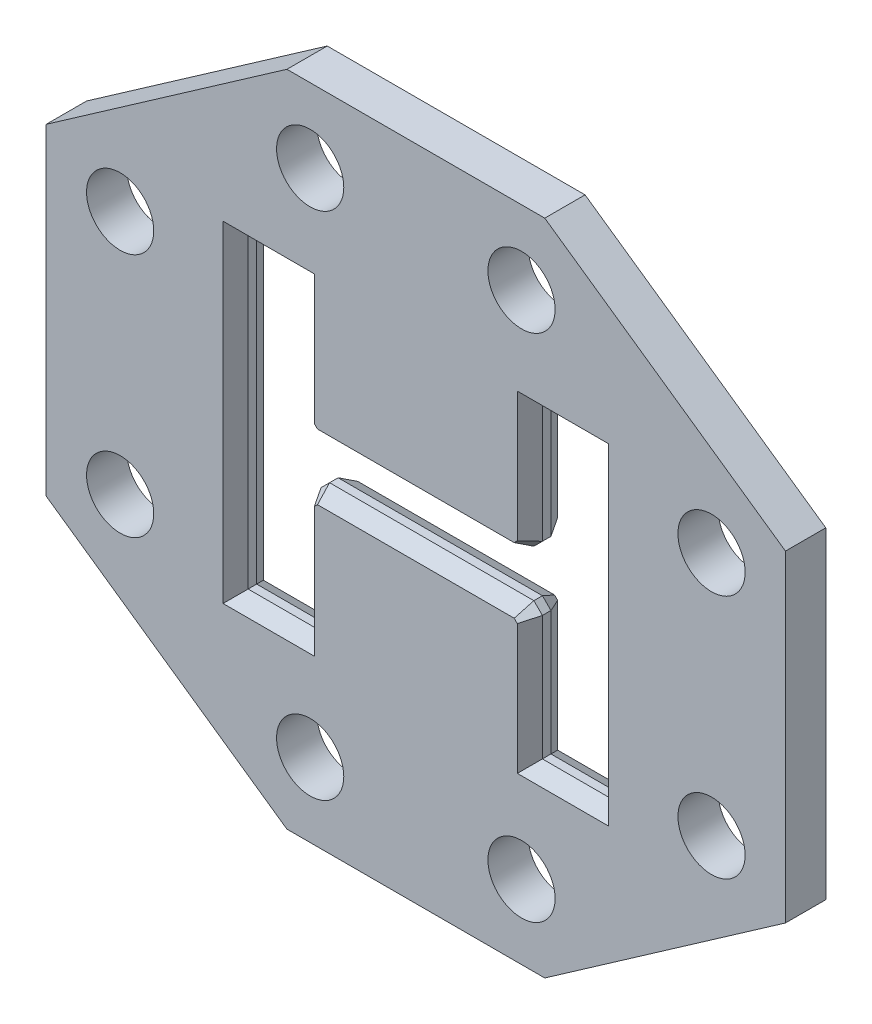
ISO-10303-21;
HEADER;
FILE_DESCRIPTION(('STEP AP214'),'2;1');
FILE_NAME('part.step','',(''),(''),'','','');
FILE_SCHEMA(('AUTOMOTIVE_DESIGN { 1 0 10303 214 1 1 1 1 }'));
ENDSEC;
DATA;
#1=APPLICATION_CONTEXT('core data for automotive mechanical design processes');
#2=APPLICATION_PROTOCOL_DEFINITION('international standard','automotive_design',2000,#1);
#3=PRODUCT_CONTEXT('',#1,'mechanical');
#4=PRODUCT('Part','Part','',(#3));
#5=PRODUCT_RELATED_PRODUCT_CATEGORY('part','',(#4));
#6=PRODUCT_DEFINITION_FORMATION('','',#4);
#7=PRODUCT_DEFINITION_CONTEXT('part definition',#1,'design');
#8=PRODUCT_DEFINITION('design','',#6,#7);
#9=PRODUCT_DEFINITION_SHAPE('','',#8);
#10=(LENGTH_UNIT() NAMED_UNIT(*) SI_UNIT(.MILLI.,.METRE.));
#11=(NAMED_UNIT(*) PLANE_ANGLE_UNIT() SI_UNIT($,.RADIAN.));
#12=(NAMED_UNIT(*) SI_UNIT($,.STERADIAN.) SOLID_ANGLE_UNIT());
#13=UNCERTAINTY_MEASURE_WITH_UNIT(LENGTH_MEASURE(1.E-05),#10,'distance_accuracy_value','');
#14=(GEOMETRIC_REPRESENTATION_CONTEXT(3) GLOBAL_UNCERTAINTY_ASSIGNED_CONTEXT((#13)) GLOBAL_UNIT_ASSIGNED_CONTEXT((#10,
#11,#12)) REPRESENTATION_CONTEXT('',''));
#15=CARTESIAN_POINT('',(0.,0.,0.));
#16=DIRECTION('',(0.,0.,1.));
#17=DIRECTION('',(1.,0.,0.));
#18=AXIS2_PLACEMENT_3D('',#15,#16,#17);
#19=CARTESIAN_POINT('',(156.845,-230.378,28.575));
#20=DIRECTION('',(1.,0.,0.));
#21=DIRECTION('',(0.,0.,-1.));
#22=AXIS2_PLACEMENT_3D('',#19,#20,#21);
#23=PLANE('',#22);
#24=DIRECTION('',(0.,0.,-1.));
#25=VECTOR('',#24,1.);
#26=CARTESIAN_POINT('',(156.845,-221.615,28.575));
#27=LINE('',#26,#25);
#28=CARTESIAN_POINT('',(156.845,-221.615,6.05833950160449));
#29=VERTEX_POINT('',#28);
#30=CARTESIAN_POINT('',(156.845,-221.615,-6.05833950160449));
#31=VERTEX_POINT('',#30);
#32=EDGE_CURVE('E710',#29,#31,#27,.T.);
#33=ORIENTED_EDGE('',*,*,#32,.T.);
#34=DIRECTION('',(0.,1.,0.));
#35=VECTOR('',#34,1.);
#36=CARTESIAN_POINT('',(156.845,-230.378,-6.05833950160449));
#37=LINE('',#36,#35);
#38=CARTESIAN_POINT('',(156.845,-45.4659999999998,-6.05833950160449));
#39=VERTEX_POINT('',#38);
#40=EDGE_CURVE('E58',#31,#39,#37,.T.);
#41=ORIENTED_EDGE('',*,*,#40,.T.);
#42=DIRECTION('',(0.,0.,-1.));
#43=VECTOR('',#42,1.);
#44=CARTESIAN_POINT('',(156.845,-45.4659999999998,28.575));
#45=LINE('',#44,#43);
#46=CARTESIAN_POINT('',(156.845,-45.4659999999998,6.05833950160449));
#47=VERTEX_POINT('',#46);
#48=EDGE_CURVE('E708',#47,#39,#45,.T.);
#49=ORIENTED_EDGE('',*,*,#48,.F.);
#50=DIRECTION('',(0.,-1.,0.));
#51=VECTOR('',#50,1.);
#52=CARTESIAN_POINT('',(156.845,-221.615,6.05833950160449));
#53=LINE('',#52,#51);
#54=EDGE_CURVE('E439',#47,#29,#53,.T.);
#55=ORIENTED_EDGE('',*,*,#54,.T.);
#56=EDGE_LOOP('',(#33,#41,#49,#55));
#57=FACE_BOUND('',#56,.T.);
#58=ADVANCED_FACE('F47',(#57),#23,.T.);
#59=CARTESIAN_POINT('',(-156.845,230.378,28.575));
#60=DIRECTION('',(-1.,0.,0.));
#61=DIRECTION('',(0.,0.,1.));
#62=AXIS2_PLACEMENT_3D('',#59,#60,#61);
#63=PLANE('',#62);
#64=DIRECTION('',(0.,0.,-1.));
#65=VECTOR('',#64,1.);
#66=CARTESIAN_POINT('',(-156.845,221.615,28.575));
#67=LINE('',#66,#65);
#68=CARTESIAN_POINT('',(-156.845,221.615,6.05833950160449));
#69=VERTEX_POINT('',#68);
#70=CARTESIAN_POINT('',(-156.845,221.615,-6.05833950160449));
#71=VERTEX_POINT('',#70);
#72=EDGE_CURVE('E740',#69,#71,#67,.T.);
#73=ORIENTED_EDGE('',*,*,#72,.T.);
#74=DIRECTION('',(0.,-1.,0.));
#75=VECTOR('',#74,1.);
#76=CARTESIAN_POINT('',(-156.845,230.378,-6.05833950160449));
#77=LINE('',#76,#75);
#78=CARTESIAN_POINT('',(-156.845,45.4660000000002,-6.05833950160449));
#79=VERTEX_POINT('',#78);
#80=EDGE_CURVE('E573',#71,#79,#77,.T.);
#81=ORIENTED_EDGE('',*,*,#80,.T.);
#82=DIRECTION('',(0.,0.,-1.));
#83=VECTOR('',#82,1.);
#84=CARTESIAN_POINT('',(-156.845,45.4660000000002,28.575));
#85=LINE('',#84,#83);
#86=CARTESIAN_POINT('',(-156.845,45.4660000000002,6.05833950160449));
#87=VERTEX_POINT('',#86);
#88=EDGE_CURVE('E743',#87,#79,#85,.T.);
#89=ORIENTED_EDGE('',*,*,#88,.F.);
#90=DIRECTION('',(0.,1.,0.));
#91=VECTOR('',#90,1.);
#92=CARTESIAN_POINT('',(-156.845,221.615,6.05833950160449));
#93=LINE('',#92,#91);
#94=EDGE_CURVE('E418',#87,#69,#93,.T.);
#95=ORIENTED_EDGE('',*,*,#94,.T.);
#96=EDGE_LOOP('',(#73,#81,#89,#95));
#97=FACE_BOUND('',#96,.T.);
#98=ADVANCED_FACE('F839',(#97),#63,.T.);
#99=CARTESIAN_POINT('',(0.,0.,28.575));
#100=DIRECTION('',(0.,0.,-1.));
#101=DIRECTION('',(-1.,0.,0.));
#102=AXIS2_PLACEMENT_3D('',#99,#100,#101);
#103=PLANE('',#102);
#104=DIRECTION('',(0.,-1.,0.));
#105=VECTOR('',#104,1.);
#106=CARTESIAN_POINT('',(273.223,-221.615,28.575));
#107=LINE('',#106,#105);
#108=CARTESIAN_POINT('',(273.223,234.615,28.575));
#109=VERTEX_POINT('',#108);
#110=CARTESIAN_POINT('',(273.223,-234.615,28.575));
#111=VERTEX_POINT('',#110);
#112=EDGE_CURVE('E393',#109,#111,#107,.T.);
#113=ORIENTED_EDGE('',*,*,#112,.T.);
#114=DIRECTION('',(-1.,0.,0.));
#115=VECTOR('',#114,1.);
#116=CARTESIAN_POINT('',(156.845,-234.615,28.575));
#117=LINE('',#116,#115);
#118=CARTESIAN_POINT('',(143.845,-234.615,28.575));
#119=VERTEX_POINT('',#118);
#120=EDGE_CURVE('E394',#111,#119,#117,.T.);
#121=ORIENTED_EDGE('',*,*,#120,.T.);
#122=DIRECTION('',(0.,1.,0.));
#123=VECTOR('',#122,1.);
#124=CARTESIAN_POINT('',(143.845,-45.4659999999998,28.575));
#125=LINE('',#124,#123);
#126=CARTESIAN_POINT('',(143.845,-50.8507763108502,28.575));
#127=VERTEX_POINT('',#126);
#128=EDGE_CURVE('E345',#119,#127,#125,.T.);
#129=ORIENTED_EDGE('',*,*,#128,.T.);
#130=DIRECTION('',(-0.707106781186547,0.707106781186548,0.));
#131=VECTOR('',#130,1.);
#132=CARTESIAN_POINT('',(135.587611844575,-42.593388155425,28.575));
#133=LINE('',#132,#131);
#134=CARTESIAN_POINT('',(139.39522368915,-46.4009999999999,28.575));
#135=VERTEX_POINT('',#134);
#136=EDGE_CURVE('E355',#127,#135,#133,.T.);
#137=ORIENTED_EDGE('',*,*,#136,.T.);
#138=DIRECTION('',(-1.,0.,0.));
#139=VECTOR('',#138,1.);
#140=CARTESIAN_POINT('',(-144.78,-46.4009999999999,28.575));
#141=LINE('',#140,#139);
#142=CARTESIAN_POINT('',(-139.39522368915,-46.4009999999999,28.575));
#143=VERTEX_POINT('',#142);
#144=EDGE_CURVE('E354',#135,#143,#141,.T.);
#145=ORIENTED_EDGE('',*,*,#144,.T.);
#146=DIRECTION('',(-0.707106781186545,-0.70710678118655,0.));
#147=VECTOR('',#146,1.);
#148=CARTESIAN_POINT('',(-147.652611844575,-54.658388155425,28.575));
#149=LINE('',#148,#147);
#150=CARTESIAN_POINT('',(-143.845,-50.8507763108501,28.575));
#151=VERTEX_POINT('',#150);
#152=EDGE_CURVE('E356',#143,#151,#149,.T.);
#153=ORIENTED_EDGE('',*,*,#152,.T.);
#154=DIRECTION('',(0.,-1.,0.));
#155=VECTOR('',#154,1.);
#156=CARTESIAN_POINT('',(-143.845,-221.615,28.575));
#157=LINE('',#156,#155);
#158=CARTESIAN_POINT('',(-143.845,-234.615,28.575));
#159=VERTEX_POINT('',#158);
#160=EDGE_CURVE('E363',#151,#159,#157,.T.);
#161=ORIENTED_EDGE('',*,*,#160,.T.);
#162=DIRECTION('',(-1.,0.,0.));
#163=VECTOR('',#162,1.);
#164=CARTESIAN_POINT('',(-260.223,-234.615,28.575));
#165=LINE('',#164,#163);
#166=CARTESIAN_POINT('',(-273.223,-234.615,28.575));
#167=VERTEX_POINT('',#166);
#168=EDGE_CURVE('E364',#159,#167,#165,.T.);
#169=ORIENTED_EDGE('',*,*,#168,.T.);
#170=DIRECTION('',(0.,1.,0.));
#171=VECTOR('',#170,1.);
#172=CARTESIAN_POINT('',(-273.223,221.615,28.575));
#173=LINE('',#172,#171);
#174=CARTESIAN_POINT('',(-273.223,234.615,28.575));
#175=VERTEX_POINT('',#174);
#176=EDGE_CURVE('E370',#167,#175,#173,.T.);
#177=ORIENTED_EDGE('',*,*,#176,.T.);
#178=DIRECTION('',(1.,0.,0.));
#179=VECTOR('',#178,1.);
#180=CARTESIAN_POINT('',(-156.845,234.615,28.575));
#181=LINE('',#180,#179);
#182=CARTESIAN_POINT('',(-143.845,234.615,28.575));
#183=VERTEX_POINT('',#182);
#184=EDGE_CURVE('E369',#175,#183,#181,.T.);
#185=ORIENTED_EDGE('',*,*,#184,.T.);
#186=DIRECTION('',(0.,-1.,0.));
#187=VECTOR('',#186,1.);
#188=CARTESIAN_POINT('',(-143.845,45.4660000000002,28.575));
#189=LINE('',#188,#187);
#190=CARTESIAN_POINT('',(-143.845,50.8507763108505,28.575));
#191=VERTEX_POINT('',#190);
#192=EDGE_CURVE('E373',#183,#191,#189,.T.);
#193=ORIENTED_EDGE('',*,*,#192,.T.);
#194=DIRECTION('',(0.707106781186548,-0.707106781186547,0.));
#195=VECTOR('',#194,1.);
#196=CARTESIAN_POINT('',(-135.587611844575,42.5933881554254,28.575));
#197=LINE('',#196,#195);
#198=CARTESIAN_POINT('',(-139.39522368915,46.4010000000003,28.575));
#199=VERTEX_POINT('',#198);
#200=EDGE_CURVE('E376',#191,#199,#197,.T.);
#201=ORIENTED_EDGE('',*,*,#200,.T.);
#202=DIRECTION('',(1.,0.,0.));
#203=VECTOR('',#202,1.);
#204=CARTESIAN_POINT('',(144.78,46.4010000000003,28.575));
#205=LINE('',#204,#203);
#206=CARTESIAN_POINT('',(139.39522368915,46.4010000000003,28.575));
#207=VERTEX_POINT('',#206);
#208=EDGE_CURVE('E378',#199,#207,#205,.T.);
#209=ORIENTED_EDGE('',*,*,#208,.T.);
#210=DIRECTION('',(0.707106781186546,0.707106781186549,0.));
#211=VECTOR('',#210,1.);
#212=CARTESIAN_POINT('',(147.652611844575,54.6583881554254,28.575));
#213=LINE('',#212,#211);
#214=CARTESIAN_POINT('',(143.845,50.8507763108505,28.575));
#215=VERTEX_POINT('',#214);
#216=EDGE_CURVE('E385',#207,#215,#213,.T.);
#217=ORIENTED_EDGE('',*,*,#216,.T.);
#218=DIRECTION('',(0.,1.,0.));
#219=VECTOR('',#218,1.);
#220=CARTESIAN_POINT('',(143.845,221.615,28.575));
#221=LINE('',#220,#219);
#222=CARTESIAN_POINT('',(143.845,234.615,28.575));
#223=VERTEX_POINT('',#222);
#224=EDGE_CURVE('E383',#215,#223,#221,.T.);
#225=ORIENTED_EDGE('',*,*,#224,.T.);
#226=DIRECTION('',(1.,0.,0.));
#227=VECTOR('',#226,1.);
#228=CARTESIAN_POINT('',(260.223,234.615,28.575));
#229=LINE('',#228,#227);
#230=EDGE_CURVE('E387',#223,#109,#229,.T.);
#231=ORIENTED_EDGE('',*,*,#230,.T.);
#232=EDGE_LOOP('',(#113,#121,#129,#137,#145,#153,#161,#169,#177,#185,#193,#201,#209,#217,#225,#231));
#233=FACE_BOUND('',#232,.T.);
#234=CARTESIAN_POINT('',(-149.758610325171,-361.549268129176,28.575));
#235=DIRECTION('',(0.,0.,1.));
#236=DIRECTION('',(1.,0.,0.));
#237=AXIS2_PLACEMENT_3D('',#234,#235,#236);
#238=CIRCLE('',#237,47.625);
#239=CARTESIAN_POINT('',(-102.133610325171,-361.549268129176,28.575));
#240=VERTEX_POINT('',#239);
#241=EDGE_CURVE('E1683',#240,#240,#238,.T.);
#242=ORIENTED_EDGE('',*,*,#241,.F.);
#243=EDGE_LOOP('',(#242));
#244=FACE_BOUND('',#243,.T.);
#245=CARTESIAN_POINT('',(149.758610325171,-361.549268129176,28.575));
#246=DIRECTION('',(0.,0.,1.));
#247=DIRECTION('',(1.,0.,0.));
#248=AXIS2_PLACEMENT_3D('',#245,#246,#247);
#249=CIRCLE('',#248,47.625);
#250=CARTESIAN_POINT('',(197.383610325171,-361.549268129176,28.575));
#251=VERTEX_POINT('',#250);
#252=EDGE_CURVE('E1690',#251,#251,#249,.T.);
#253=ORIENTED_EDGE('',*,*,#252,.F.);
#254=EDGE_LOOP('',(#253));
#255=FACE_BOUND('',#254,.T.);
#256=CARTESIAN_POINT('',(419.080268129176,-173.588730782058,28.575));
#257=DIRECTION('',(0.,0.,1.));
#258=DIRECTION('',(1.,0.,0.));
#259=AXIS2_PLACEMENT_3D('',#256,#257,#258);
#260=CIRCLE('',#259,47.625);
#261=CARTESIAN_POINT('',(466.705268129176,-173.588730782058,28.575));
#262=VERTEX_POINT('',#261);
#263=EDGE_CURVE('E1691',#262,#262,#260,.T.);
#264=ORIENTED_EDGE('',*,*,#263,.F.);
#265=EDGE_LOOP('',(#264));
#266=FACE_BOUND('',#265,.T.);
#267=CARTESIAN_POINT('',(419.080268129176,173.588730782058,28.575));
#268=DIRECTION('',(0.,0.,1.));
#269=DIRECTION('',(1.,0.,0.));
#270=AXIS2_PLACEMENT_3D('',#267,#268,#269);
#271=CIRCLE('',#270,47.625);
#272=CARTESIAN_POINT('',(466.705268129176,173.588730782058,28.575));
#273=VERTEX_POINT('',#272);
#274=EDGE_CURVE('E1700',#273,#273,#271,.T.);
#275=ORIENTED_EDGE('',*,*,#274,.F.);
#276=EDGE_LOOP('',(#275));
#277=FACE_BOUND('',#276,.T.);
#278=CARTESIAN_POINT('',(149.758610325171,361.549268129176,28.575));
#279=DIRECTION('',(0.,0.,1.));
#280=DIRECTION('',(1.,0.,0.));
#281=AXIS2_PLACEMENT_3D('',#278,#279,#280);
#282=CIRCLE('',#281,47.625);
#283=CARTESIAN_POINT('',(197.383610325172,361.549268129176,28.575));
#284=VERTEX_POINT('',#283);
#285=EDGE_CURVE('E1702',#284,#284,#282,.T.);
#286=ORIENTED_EDGE('',*,*,#285,.F.);
#287=EDGE_LOOP('',(#286));
#288=FACE_BOUND('',#287,.T.);
#289=CARTESIAN_POINT('',(-149.758610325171,361.549268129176,28.575));
#290=DIRECTION('',(0.,0.,1.));
#291=DIRECTION('',(1.,0.,0.));
#292=AXIS2_PLACEMENT_3D('',#289,#290,#291);
#293=CIRCLE('',#292,47.625);
#294=CARTESIAN_POINT('',(-102.133610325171,361.549268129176,28.575));
#295=VERTEX_POINT('',#294);
#296=EDGE_CURVE('E1703',#295,#295,#293,.T.);
#297=ORIENTED_EDGE('',*,*,#296,.F.);
#298=EDGE_LOOP('',(#297));
#299=FACE_BOUND('',#298,.T.);
#300=CARTESIAN_POINT('',(-419.080268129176,173.588730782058,28.575));
#301=DIRECTION('',(0.,0.,1.));
#302=DIRECTION('',(1.,0.,0.));
#303=AXIS2_PLACEMENT_3D('',#300,#301,#302);
#304=CIRCLE('',#303,47.625);
#305=CARTESIAN_POINT('',(-371.455268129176,173.588730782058,28.575));
#306=VERTEX_POINT('',#305);
#307=EDGE_CURVE('E1710',#306,#306,#304,.T.);
#308=ORIENTED_EDGE('',*,*,#307,.F.);
#309=EDGE_LOOP('',(#308));
#310=FACE_BOUND('',#309,.T.);
#311=CARTESIAN_POINT('',(-419.080268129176,-173.588730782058,28.575));
#312=DIRECTION('',(0.,0.,1.));
#313=DIRECTION('',(1.,0.,0.));
#314=AXIS2_PLACEMENT_3D('',#311,#312,#313);
#315=CIRCLE('',#314,47.625);
#316=CARTESIAN_POINT('',(-371.455268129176,-173.588730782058,28.575));
#317=VERTEX_POINT('',#316);
#318=EDGE_CURVE('E693',#317,#317,#315,.T.);
#319=ORIENTED_EDGE('',*,*,#318,.F.);
#320=EDGE_LOOP('',(#319));
#321=FACE_BOUND('',#320,.T.);
#322=DIRECTION('',(0.,-1.,0.));
#323=VECTOR('',#322,1.);
#324=CARTESIAN_POINT('',(-523.855268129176,-228.234235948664,28.575));
#325=LINE('',#324,#323);
#326=CARTESIAN_POINT('',(-523.855268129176,228.234235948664,28.575));
#327=VERTEX_POINT('',#326);
#328=CARTESIAN_POINT('',(-523.855268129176,-228.234235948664,28.575));
#329=VERTEX_POINT('',#328);
#330=EDGE_CURVE('E322',#327,#329,#325,.T.);
#331=ORIENTED_EDGE('',*,*,#330,.T.);
#332=DIRECTION('',(0.820038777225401,-0.572307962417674,0.));
#333=VECTOR('',#332,1.);
#334=CARTESIAN_POINT('',(-182.70492307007,-466.324268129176,28.575));
#335=LINE('',#334,#333);
#336=CARTESIAN_POINT('',(-182.70492307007,-466.324268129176,28.575));
#337=VERTEX_POINT('',#336);
#338=EDGE_CURVE('E311',#329,#337,#335,.T.);
#339=ORIENTED_EDGE('',*,*,#338,.T.);
#340=DIRECTION('',(1.,0.,0.));
#341=VECTOR('',#340,1.);
#342=CARTESIAN_POINT('',(182.70492307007,-466.324268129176,28.575));
#343=LINE('',#342,#341);
#344=CARTESIAN_POINT('',(182.70492307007,-466.324268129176,28.575));
#345=VERTEX_POINT('',#344);
#346=EDGE_CURVE('E324',#337,#345,#343,.T.);
#347=ORIENTED_EDGE('',*,*,#346,.T.);
#348=DIRECTION('',(0.820038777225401,0.572307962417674,0.));
#349=VECTOR('',#348,1.);
#350=CARTESIAN_POINT('',(523.855268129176,-228.234235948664,28.575));
#351=LINE('',#350,#349);
#352=CARTESIAN_POINT('',(523.855268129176,-228.234235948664,28.575));
#353=VERTEX_POINT('',#352);
#354=EDGE_CURVE('E750',#345,#353,#351,.T.);
#355=ORIENTED_EDGE('',*,*,#354,.T.);
#356=DIRECTION('',(0.,1.,0.));
#357=VECTOR('',#356,1.);
#358=CARTESIAN_POINT('',(523.855268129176,228.234235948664,28.575));
#359=LINE('',#358,#357);
#360=CARTESIAN_POINT('',(523.855268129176,228.234235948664,28.575));
#361=VERTEX_POINT('',#360);
#362=EDGE_CURVE('E755',#353,#361,#359,.T.);
#363=ORIENTED_EDGE('',*,*,#362,.T.);
#364=DIRECTION('',(-0.820038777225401,0.572307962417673,0.));
#365=VECTOR('',#364,1.);
#366=CARTESIAN_POINT('',(182.70492307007,466.324268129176,28.575));
#367=LINE('',#366,#365);
#368=CARTESIAN_POINT('',(182.70492307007,466.324268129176,28.575));
#369=VERTEX_POINT('',#368);
#370=EDGE_CURVE('E752',#361,#369,#367,.T.);
#371=ORIENTED_EDGE('',*,*,#370,.T.);
#372=DIRECTION('',(-1.,0.,0.));
#373=VECTOR('',#372,1.);
#374=CARTESIAN_POINT('',(-182.704923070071,466.324268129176,28.575));
#375=LINE('',#374,#373);
#376=CARTESIAN_POINT('',(-182.704923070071,466.324268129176,28.575));
#377=VERTEX_POINT('',#376);
#378=EDGE_CURVE('E758',#369,#377,#375,.T.);
#379=ORIENTED_EDGE('',*,*,#378,.T.);
#380=DIRECTION('',(-0.8200387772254,-0.572307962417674,0.));
#381=VECTOR('',#380,1.);
#382=CARTESIAN_POINT('',(-523.855268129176,228.234235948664,28.575));
#383=LINE('',#382,#381);
#384=EDGE_CURVE('E326',#377,#327,#383,.T.);
#385=ORIENTED_EDGE('',*,*,#384,.T.);
#386=EDGE_LOOP('',(#331,#339,#347,#355,#363,#371,#379,#385));
#387=FACE_BOUND('',#386,.T.);
#388=ADVANCED_FACE('F328',(#233,#244,#255,#266,#277,#288,#299,#310,#321,#387),#103,.F.);
#389=CARTESIAN_POINT('',(0.,0.,-28.575));
#390=DIRECTION('',(0.,0.,-1.));
#391=DIRECTION('',(-1.,0.,0.));
#392=AXIS2_PLACEMENT_3D('',#389,#390,#391);
#393=PLANE('',#392);
#394=DIRECTION('',(0.707106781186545,0.70710678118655,0.));
#395=VECTOR('',#394,1.);
#396=CARTESIAN_POINT('',(-46.4971118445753,46.497111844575,-28.575));
#397=LINE('',#396,#395);
#398=CARTESIAN_POINT('',(-143.845,-50.8507763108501,-28.575));
#399=VERTEX_POINT('',#398);
#400=CARTESIAN_POINT('',(-139.39522368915,-46.401,-28.575));
#401=VERTEX_POINT('',#400);
#402=EDGE_CURVE('E546',#399,#401,#397,.T.);
#403=ORIENTED_EDGE('',*,*,#402,.T.);
#404=DIRECTION('',(1.,0.,0.));
#405=VECTOR('',#404,1.);
#406=CARTESIAN_POINT('',(0.,-46.401,-28.575));
#407=LINE('',#406,#405);
#408=CARTESIAN_POINT('',(139.39522368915,-46.401,-28.575));
#409=VERTEX_POINT('',#408);
#410=EDGE_CURVE('E553',#401,#409,#407,.T.);
#411=ORIENTED_EDGE('',*,*,#410,.T.);
#412=DIRECTION('',(0.707106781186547,-0.707106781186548,0.));
#413=VECTOR('',#412,1.);
#414=CARTESIAN_POINT('',(46.497111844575,46.4971118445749,-28.575));
#415=LINE('',#414,#413);
#416=CARTESIAN_POINT('',(143.845,-50.8507763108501,-28.575));
#417=VERTEX_POINT('',#416);
#418=EDGE_CURVE('E442',#409,#417,#415,.T.);
#419=ORIENTED_EDGE('',*,*,#418,.T.);
#420=DIRECTION('',(0.,-1.,0.));
#421=VECTOR('',#420,1.);
#422=CARTESIAN_POINT('',(143.845,0.,-28.575));
#423=LINE('',#422,#421);
#424=CARTESIAN_POINT('',(143.845,-234.615,-28.575));
#425=VERTEX_POINT('',#424);
#426=EDGE_CURVE('E508',#417,#425,#423,.T.);
#427=ORIENTED_EDGE('',*,*,#426,.T.);
#428=DIRECTION('',(1.,0.,0.));
#429=VECTOR('',#428,1.);
#430=CARTESIAN_POINT('',(0.,-234.615,-28.575));
#431=LINE('',#430,#429);
#432=CARTESIAN_POINT('',(273.223,-234.615,-28.575));
#433=VERTEX_POINT('',#432);
#434=EDGE_CURVE('E515',#425,#433,#431,.T.);
#435=ORIENTED_EDGE('',*,*,#434,.T.);
#436=DIRECTION('',(0.,1.,0.));
#437=VECTOR('',#436,1.);
#438=CARTESIAN_POINT('',(273.223,0.,-28.575));
#439=LINE('',#438,#437);
#440=CARTESIAN_POINT('',(273.223,234.615,-28.575));
#441=VERTEX_POINT('',#440);
#442=EDGE_CURVE('E513',#433,#441,#439,.T.);
#443=ORIENTED_EDGE('',*,*,#442,.T.);
#444=DIRECTION('',(-1.,0.,0.));
#445=VECTOR('',#444,1.);
#446=CARTESIAN_POINT('',(0.,234.615,-28.575));
#447=LINE('',#446,#445);
#448=CARTESIAN_POINT('',(143.845,234.615,-28.575));
#449=VERTEX_POINT('',#448);
#450=EDGE_CURVE('E517',#441,#449,#447,.T.);
#451=ORIENTED_EDGE('',*,*,#450,.T.);
#452=DIRECTION('',(0.,-1.,0.));
#453=VECTOR('',#452,1.);
#454=CARTESIAN_POINT('',(143.845,0.,-28.575));
#455=LINE('',#454,#453);
#456=CARTESIAN_POINT('',(143.845,50.8507763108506,-28.575));
#457=VERTEX_POINT('',#456);
#458=EDGE_CURVE('E523',#449,#457,#455,.T.);
#459=ORIENTED_EDGE('',*,*,#458,.T.);
#460=DIRECTION('',(-0.707106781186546,-0.707106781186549,0.));
#461=VECTOR('',#460,1.);
#462=CARTESIAN_POINT('',(46.4971118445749,-46.4971118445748,-28.575));
#463=LINE('',#462,#461);
#464=CARTESIAN_POINT('',(139.39522368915,46.4010000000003,-28.575));
#465=VERTEX_POINT('',#464);
#466=EDGE_CURVE('E524',#457,#465,#463,.T.);
#467=ORIENTED_EDGE('',*,*,#466,.T.);
#468=DIRECTION('',(-1.,0.,0.));
#469=VECTOR('',#468,1.);
#470=CARTESIAN_POINT('',(0.,46.4010000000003,-28.575));
#471=LINE('',#470,#469);
#472=CARTESIAN_POINT('',(-139.39522368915,46.4010000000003,-28.575));
#473=VERTEX_POINT('',#472);
#474=EDGE_CURVE('E530',#465,#473,#471,.T.);
#475=ORIENTED_EDGE('',*,*,#474,.T.);
#476=DIRECTION('',(-0.707106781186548,0.707106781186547,0.));
#477=VECTOR('',#476,1.);
#478=CARTESIAN_POINT('',(-46.4971118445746,-46.4971118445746,-28.575));
#479=LINE('',#478,#477);
#480=CARTESIAN_POINT('',(-143.845,50.8507763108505,-28.575));
#481=VERTEX_POINT('',#480);
#482=EDGE_CURVE('E529',#473,#481,#479,.T.);
#483=ORIENTED_EDGE('',*,*,#482,.T.);
#484=DIRECTION('',(0.,1.,0.));
#485=VECTOR('',#484,1.);
#486=CARTESIAN_POINT('',(-143.845,0.,-28.575));
#487=LINE('',#486,#485);
#488=CARTESIAN_POINT('',(-143.845,234.615,-28.575));
#489=VERTEX_POINT('',#488);
#490=EDGE_CURVE('E531',#481,#489,#487,.T.);
#491=ORIENTED_EDGE('',*,*,#490,.T.);
#492=DIRECTION('',(-1.,0.,0.));
#493=VECTOR('',#492,1.);
#494=CARTESIAN_POINT('',(2.51963643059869E-13,234.615,-28.575));
#495=LINE('',#494,#493);
#496=CARTESIAN_POINT('',(-273.223,234.615,-28.575));
#497=VERTEX_POINT('',#496);
#498=EDGE_CURVE('E538',#489,#497,#495,.T.);
#499=ORIENTED_EDGE('',*,*,#498,.T.);
#500=DIRECTION('',(0.,-1.,0.));
#501=VECTOR('',#500,1.);
#502=CARTESIAN_POINT('',(-273.223,0.,-28.575));
#503=LINE('',#502,#501);
#504=CARTESIAN_POINT('',(-273.223,-234.615,-28.575));
#505=VERTEX_POINT('',#504);
#506=EDGE_CURVE('E540',#497,#505,#503,.T.);
#507=ORIENTED_EDGE('',*,*,#506,.T.);
#508=DIRECTION('',(1.,0.,0.));
#509=VECTOR('',#508,1.);
#510=CARTESIAN_POINT('',(0.,-234.615,-28.575));
#511=LINE('',#510,#509);
#512=CARTESIAN_POINT('',(-143.845,-234.615,-28.575));
#513=VERTEX_POINT('',#512);
#514=EDGE_CURVE('E545',#505,#513,#511,.T.);
#515=ORIENTED_EDGE('',*,*,#514,.T.);
#516=DIRECTION('',(0.,1.,0.));
#517=VECTOR('',#516,1.);
#518=CARTESIAN_POINT('',(-143.845,0.,-28.575));
#519=LINE('',#518,#517);
#520=EDGE_CURVE('E542',#513,#399,#519,.T.);
#521=ORIENTED_EDGE('',*,*,#520,.T.);
#522=EDGE_LOOP('',(#403,#411,#419,#427,#435,#443,#451,#459,#467,#475,#483,#491,#499,#507,#515,#521));
#523=FACE_BOUND('',#522,.T.);
#524=CARTESIAN_POINT('',(-149.758610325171,-361.549268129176,-28.575));
#525=DIRECTION('',(0.,0.,1.));
#526=DIRECTION('',(1.,0.,0.));
#527=AXIS2_PLACEMENT_3D('',#524,#525,#526);
#528=CIRCLE('',#527,47.625);
#529=CARTESIAN_POINT('',(-102.133610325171,-361.549268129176,-28.575));
#530=VERTEX_POINT('',#529);
#531=EDGE_CURVE('E506',#530,#530,#528,.T.);
#532=ORIENTED_EDGE('',*,*,#531,.T.);
#533=EDGE_LOOP('',(#532));
#534=FACE_BOUND('',#533,.T.);
#535=CARTESIAN_POINT('',(149.758610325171,-361.549268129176,-28.575));
#536=DIRECTION('',(0.,0.,1.));
#537=DIRECTION('',(1.,0.,0.));
#538=AXIS2_PLACEMENT_3D('',#535,#536,#537);
#539=CIRCLE('',#538,47.625);
#540=CARTESIAN_POINT('',(197.383610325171,-361.549268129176,-28.575));
#541=VERTEX_POINT('',#540);
#542=EDGE_CURVE('E1719',#541,#541,#539,.T.);
#543=ORIENTED_EDGE('',*,*,#542,.T.);
#544=EDGE_LOOP('',(#543));
#545=FACE_BOUND('',#544,.T.);
#546=CARTESIAN_POINT('',(419.080268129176,-173.588730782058,-28.575));
#547=DIRECTION('',(0.,0.,1.));
#548=DIRECTION('',(1.,0.,0.));
#549=AXIS2_PLACEMENT_3D('',#546,#547,#548);
#550=CIRCLE('',#549,47.625);
#551=CARTESIAN_POINT('',(466.705268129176,-173.588730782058,-28.575));
#552=VERTEX_POINT('',#551);
#553=EDGE_CURVE('E1728',#552,#552,#550,.T.);
#554=ORIENTED_EDGE('',*,*,#553,.T.);
#555=EDGE_LOOP('',(#554));
#556=FACE_BOUND('',#555,.T.);
#557=CARTESIAN_POINT('',(419.080268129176,173.588730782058,-28.575));
#558=DIRECTION('',(0.,0.,1.));
#559=DIRECTION('',(1.,0.,0.));
#560=AXIS2_PLACEMENT_3D('',#557,#558,#559);
#561=CIRCLE('',#560,47.625);
#562=CARTESIAN_POINT('',(466.705268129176,173.588730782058,-28.575));
#563=VERTEX_POINT('',#562);
#564=EDGE_CURVE('E1735',#563,#563,#561,.T.);
#565=ORIENTED_EDGE('',*,*,#564,.T.);
#566=EDGE_LOOP('',(#565));
#567=FACE_BOUND('',#566,.T.);
#568=CARTESIAN_POINT('',(149.758610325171,361.549268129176,-28.575));
#569=DIRECTION('',(0.,0.,1.));
#570=DIRECTION('',(1.,0.,0.));
#571=AXIS2_PLACEMENT_3D('',#568,#569,#570);
#572=CIRCLE('',#571,47.625);
#573=CARTESIAN_POINT('',(197.383610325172,361.549268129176,-28.575));
#574=VERTEX_POINT('',#573);
#575=EDGE_CURVE('E1738',#574,#574,#572,.T.);
#576=ORIENTED_EDGE('',*,*,#575,.T.);
#577=EDGE_LOOP('',(#576));
#578=FACE_BOUND('',#577,.T.);
#579=CARTESIAN_POINT('',(-149.758610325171,361.549268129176,-28.575));
#580=DIRECTION('',(0.,0.,1.));
#581=DIRECTION('',(1.,0.,0.));
#582=AXIS2_PLACEMENT_3D('',#579,#580,#581);
#583=CIRCLE('',#582,47.625);
#584=CARTESIAN_POINT('',(-102.133610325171,361.549268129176,-28.575));
#585=VERTEX_POINT('',#584);
#586=EDGE_CURVE('E1743',#585,#585,#583,.T.);
#587=ORIENTED_EDGE('',*,*,#586,.T.);
#588=EDGE_LOOP('',(#587));
#589=FACE_BOUND('',#588,.T.);
#590=CARTESIAN_POINT('',(-419.080268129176,173.588730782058,-28.575));
#591=DIRECTION('',(0.,0.,1.));
#592=DIRECTION('',(1.,0.,0.));
#593=AXIS2_PLACEMENT_3D('',#590,#591,#592);
#594=CIRCLE('',#593,47.625);
#595=CARTESIAN_POINT('',(-371.455268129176,173.588730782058,-28.575));
#596=VERTEX_POINT('',#595);
#597=EDGE_CURVE('E1712',#596,#596,#594,.T.);
#598=ORIENTED_EDGE('',*,*,#597,.T.);
#599=EDGE_LOOP('',(#598));
#600=FACE_BOUND('',#599,.T.);
#601=CARTESIAN_POINT('',(-419.080268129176,-173.588730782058,-28.575));
#602=DIRECTION('',(0.,0.,1.));
#603=DIRECTION('',(1.,0.,0.));
#604=AXIS2_PLACEMENT_3D('',#601,#602,#603);
#605=CIRCLE('',#604,47.625);
#606=CARTESIAN_POINT('',(-371.455268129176,-173.588730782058,-28.575));
#607=VERTEX_POINT('',#606);
#608=EDGE_CURVE('E688',#607,#607,#605,.T.);
#609=ORIENTED_EDGE('',*,*,#608,.T.);
#610=EDGE_LOOP('',(#609));
#611=FACE_BOUND('',#610,.T.);
#612=DIRECTION('',(0.,-1.,0.));
#613=VECTOR('',#612,1.);
#614=CARTESIAN_POINT('',(-523.855268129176,-228.234235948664,-28.575));
#615=LINE('',#614,#613);
#616=CARTESIAN_POINT('',(-523.855268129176,228.234235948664,-28.575));
#617=VERTEX_POINT('',#616);
#618=CARTESIAN_POINT('',(-523.855268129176,-228.234235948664,-28.575));
#619=VERTEX_POINT('',#618);
#620=EDGE_CURVE('E340',#617,#619,#615,.T.);
#621=ORIENTED_EDGE('',*,*,#620,.F.);
#622=DIRECTION('',(-0.8200387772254,-0.572307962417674,0.));
#623=VECTOR('',#622,1.);
#624=CARTESIAN_POINT('',(-523.855268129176,228.234235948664,-28.575));
#625=LINE('',#624,#623);
#626=CARTESIAN_POINT('',(-182.704923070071,466.324268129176,-28.575));
#627=VERTEX_POINT('',#626);
#628=EDGE_CURVE('E331',#627,#617,#625,.T.);
#629=ORIENTED_EDGE('',*,*,#628,.F.);
#630=DIRECTION('',(-1.,0.,0.));
#631=VECTOR('',#630,1.);
#632=CARTESIAN_POINT('',(-182.704923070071,466.324268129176,-28.575));
#633=LINE('',#632,#631);
#634=CARTESIAN_POINT('',(182.70492307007,466.324268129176,-28.575));
#635=VERTEX_POINT('',#634);
#636=EDGE_CURVE('E783',#635,#627,#633,.T.);
#637=ORIENTED_EDGE('',*,*,#636,.F.);
#638=DIRECTION('',(-0.820038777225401,0.572307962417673,0.));
#639=VECTOR('',#638,1.);
#640=CARTESIAN_POINT('',(182.70492307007,466.324268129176,-28.575));
#641=LINE('',#640,#639);
#642=CARTESIAN_POINT('',(523.855268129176,228.234235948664,-28.575));
#643=VERTEX_POINT('',#642);
#644=EDGE_CURVE('E777',#643,#635,#641,.T.);
#645=ORIENTED_EDGE('',*,*,#644,.F.);
#646=DIRECTION('',(0.,1.,0.));
#647=VECTOR('',#646,1.);
#648=CARTESIAN_POINT('',(523.855268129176,228.234235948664,-28.575));
#649=LINE('',#648,#647);
#650=CARTESIAN_POINT('',(523.855268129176,-228.234235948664,-28.575));
#651=VERTEX_POINT('',#650);
#652=EDGE_CURVE('E773',#651,#643,#649,.T.);
#653=ORIENTED_EDGE('',*,*,#652,.F.);
#654=DIRECTION('',(0.820038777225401,0.572307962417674,0.));
#655=VECTOR('',#654,1.);
#656=CARTESIAN_POINT('',(523.855268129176,-228.234235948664,-28.575));
#657=LINE('',#656,#655);
#658=CARTESIAN_POINT('',(182.70492307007,-466.324268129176,-28.575));
#659=VERTEX_POINT('',#658);
#660=EDGE_CURVE('E775',#659,#651,#657,.T.);
#661=ORIENTED_EDGE('',*,*,#660,.F.);
#662=DIRECTION('',(1.,0.,0.));
#663=VECTOR('',#662,1.);
#664=CARTESIAN_POINT('',(182.70492307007,-466.324268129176,-28.575));
#665=LINE('',#664,#663);
#666=CARTESIAN_POINT('',(-182.70492307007,-466.324268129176,-28.575));
#667=VERTEX_POINT('',#666);
#668=EDGE_CURVE('E768',#667,#659,#665,.T.);
#669=ORIENTED_EDGE('',*,*,#668,.F.);
#670=DIRECTION('',(0.820038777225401,-0.572307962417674,0.));
#671=VECTOR('',#670,1.);
#672=CARTESIAN_POINT('',(-182.70492307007,-466.324268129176,-28.575));
#673=LINE('',#672,#671);
#674=EDGE_CURVE('E766',#619,#667,#673,.T.);
#675=ORIENTED_EDGE('',*,*,#674,.F.);
#676=EDGE_LOOP('',(#621,#629,#637,#645,#653,#661,#669,#675));
#677=FACE_BOUND('',#676,.T.);
#678=ADVANCED_FACE('F814',(#523,#534,#545,#556,#567,#578,#589,#600,#611,#677),#393,.T.);
#679=CARTESIAN_POINT('',(-523.855268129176,-228.234235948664,28.575));
#680=DIRECTION('',(1.,0.,0.));
#681=DIRECTION('',(0.,0.,-1.));
#682=AXIS2_PLACEMENT_3D('',#679,#680,#681);
#683=PLANE('',#682);
#684=ORIENTED_EDGE('',*,*,#620,.T.);
#685=DIRECTION('',(0.,0.,-1.));
#686=VECTOR('',#685,1.);
#687=CARTESIAN_POINT('',(-523.855268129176,-228.234235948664,28.575));
#688=LINE('',#687,#686);
#689=EDGE_CURVE('E314',#329,#619,#688,.T.);
#690=ORIENTED_EDGE('',*,*,#689,.F.);
#691=ORIENTED_EDGE('',*,*,#330,.F.);
#692=DIRECTION('',(0.,0.,-1.));
#693=VECTOR('',#692,1.);
#694=CARTESIAN_POINT('',(-523.855268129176,228.234235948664,28.575));
#695=LINE('',#694,#693);
#696=EDGE_CURVE('E763',#327,#617,#695,.T.);
#697=ORIENTED_EDGE('',*,*,#696,.T.);
#698=EDGE_LOOP('',(#684,#690,#691,#697));
#699=FACE_BOUND('',#698,.T.);
#700=ADVANCED_FACE('F334',(#699),#683,.F.);
#701=CARTESIAN_POINT('',(-182.70492307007,-466.324268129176,28.575));
#702=DIRECTION('',(0.572307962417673,0.820038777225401,0.));
#703=DIRECTION('',(-0.820038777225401,0.572307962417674,0.));
#704=AXIS2_PLACEMENT_3D('',#701,#702,#703);
#705=PLANE('',#704);
#706=ORIENTED_EDGE('',*,*,#674,.T.);
#707=DIRECTION('',(0.,0.,-1.));
#708=VECTOR('',#707,1.);
#709=CARTESIAN_POINT('',(-182.70492307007,-466.324268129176,28.575));
#710=LINE('',#709,#708);
#711=EDGE_CURVE('E319',#337,#667,#710,.T.);
#712=ORIENTED_EDGE('',*,*,#711,.F.);
#713=ORIENTED_EDGE('',*,*,#338,.F.);
#714=ORIENTED_EDGE('',*,*,#689,.T.);
#715=EDGE_LOOP('',(#706,#712,#713,#714));
#716=FACE_BOUND('',#715,.T.);
#717=ADVANCED_FACE('F312',(#716),#705,.F.);
#718=CARTESIAN_POINT('',(182.70492307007,-466.324268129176,28.575));
#719=DIRECTION('',(0.,1.,0.));
#720=DIRECTION('',(0.,0.,1.));
#721=AXIS2_PLACEMENT_3D('',#718,#719,#720);
#722=PLANE('',#721);
#723=ORIENTED_EDGE('',*,*,#668,.T.);
#724=DIRECTION('',(0.,0.,-1.));
#725=VECTOR('',#724,1.);
#726=CARTESIAN_POINT('',(182.70492307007,-466.324268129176,28.575));
#727=LINE('',#726,#725);
#728=EDGE_CURVE('E348',#345,#659,#727,.T.);
#729=ORIENTED_EDGE('',*,*,#728,.F.);
#730=ORIENTED_EDGE('',*,*,#346,.F.);
#731=ORIENTED_EDGE('',*,*,#711,.T.);
#732=EDGE_LOOP('',(#723,#729,#730,#731));
#733=FACE_BOUND('',#732,.T.);
#734=ADVANCED_FACE('F828',(#733),#722,.F.);
#735=CARTESIAN_POINT('',(523.855268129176,-228.234235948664,28.575));
#736=DIRECTION('',(-0.572307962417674,0.820038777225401,0.));
#737=DIRECTION('',(-0.820038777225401,-0.572307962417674,0.));
#738=AXIS2_PLACEMENT_3D('',#735,#736,#737);
#739=PLANE('',#738);
#740=ORIENTED_EDGE('',*,*,#660,.T.);
#741=DIRECTION('',(0.,0.,-1.));
#742=VECTOR('',#741,1.);
#743=CARTESIAN_POINT('',(523.855268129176,-228.234235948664,28.575));
#744=LINE('',#743,#742);
#745=EDGE_CURVE('E796',#353,#651,#744,.T.);
#746=ORIENTED_EDGE('',*,*,#745,.F.);
#747=ORIENTED_EDGE('',*,*,#354,.F.);
#748=ORIENTED_EDGE('',*,*,#728,.T.);
#749=EDGE_LOOP('',(#740,#746,#747,#748));
#750=FACE_BOUND('',#749,.T.);
#751=ADVANCED_FACE('F807',(#750),#739,.F.);
#752=CARTESIAN_POINT('',(523.855268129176,228.234235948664,28.575));
#753=DIRECTION('',(-1.,0.,0.));
#754=DIRECTION('',(0.,-1.,0.));
#755=AXIS2_PLACEMENT_3D('',#752,#753,#754);
#756=PLANE('',#755);
#757=ORIENTED_EDGE('',*,*,#652,.T.);
#758=DIRECTION('',(0.,0.,-1.));
#759=VECTOR('',#758,1.);
#760=CARTESIAN_POINT('',(523.855268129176,228.234235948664,28.575));
#761=LINE('',#760,#759);
#762=EDGE_CURVE('E798',#361,#643,#761,.T.);
#763=ORIENTED_EDGE('',*,*,#762,.F.);
#764=ORIENTED_EDGE('',*,*,#362,.F.);
#765=ORIENTED_EDGE('',*,*,#745,.T.);
#766=EDGE_LOOP('',(#757,#763,#764,#765));
#767=FACE_BOUND('',#766,.T.);
#768=ADVANCED_FACE('F817',(#767),#756,.F.);
#769=CARTESIAN_POINT('',(182.70492307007,466.324268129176,28.575));
#770=DIRECTION('',(-0.572307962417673,-0.820038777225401,0.));
#771=DIRECTION('',(0.820038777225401,-0.572307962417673,0.));
#772=AXIS2_PLACEMENT_3D('',#769,#770,#771);
#773=PLANE('',#772);
#774=ORIENTED_EDGE('',*,*,#644,.T.);
#775=DIRECTION('',(0.,0.,-1.));
#776=VECTOR('',#775,1.);
#777=CARTESIAN_POINT('',(182.70492307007,466.324268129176,28.575));
#778=LINE('',#777,#776);
#779=EDGE_CURVE('E795',#369,#635,#778,.T.);
#780=ORIENTED_EDGE('',*,*,#779,.F.);
#781=ORIENTED_EDGE('',*,*,#370,.F.);
#782=ORIENTED_EDGE('',*,*,#762,.T.);
#783=EDGE_LOOP('',(#774,#780,#781,#782));
#784=FACE_BOUND('',#783,.T.);
#785=ADVANCED_FACE('F822',(#784),#773,.F.);
#786=CARTESIAN_POINT('',(-182.704923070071,466.324268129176,28.575));
#787=DIRECTION('',(0.,-1.,0.));
#788=DIRECTION('',(1.,0.,0.));
#789=AXIS2_PLACEMENT_3D('',#786,#787,#788);
#790=PLANE('',#789);
#791=ORIENTED_EDGE('',*,*,#636,.T.);
#792=DIRECTION('',(0.,0.,-1.));
#793=VECTOR('',#792,1.);
#794=CARTESIAN_POINT('',(-182.704923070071,466.324268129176,28.575));
#795=LINE('',#794,#793);
#796=EDGE_CURVE('E786',#377,#627,#795,.T.);
#797=ORIENTED_EDGE('',*,*,#796,.F.);
#798=ORIENTED_EDGE('',*,*,#378,.F.);
#799=ORIENTED_EDGE('',*,*,#779,.T.);
#800=EDGE_LOOP('',(#791,#797,#798,#799));
#801=FACE_BOUND('',#800,.T.);
#802=ADVANCED_FACE('F856',(#801),#790,.F.);
#803=CARTESIAN_POINT('',(-523.855268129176,228.234235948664,28.575));
#804=DIRECTION('',(0.572307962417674,-0.820038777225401,0.));
#805=DIRECTION('',(0.8200387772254,0.572307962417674,0.));
#806=AXIS2_PLACEMENT_3D('',#803,#804,#805);
#807=PLANE('',#806);
#808=ORIENTED_EDGE('',*,*,#628,.T.);
#809=ORIENTED_EDGE('',*,*,#696,.F.);
#810=ORIENTED_EDGE('',*,*,#384,.F.);
#811=ORIENTED_EDGE('',*,*,#796,.T.);
#812=EDGE_LOOP('',(#808,#809,#810,#811));
#813=FACE_BOUND('',#812,.T.);
#814=ADVANCED_FACE('F854',(#813),#807,.F.);
#815=CARTESIAN_POINT('',(156.845,54.2290000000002,28.575));
#816=DIRECTION('',(1.,0.,0.));
#817=DIRECTION('',(0.,0.,-1.));
#818=AXIS2_PLACEMENT_3D('',#815,#816,#817);
#819=PLANE('',#818);
#820=DIRECTION('',(0.,0.,-1.));
#821=VECTOR('',#820,1.);
#822=CARTESIAN_POINT('',(156.845,45.4660000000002,28.575));
#823=LINE('',#822,#821);
#824=CARTESIAN_POINT('',(156.845,45.4660000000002,6.05833950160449));
#825=VERTEX_POINT('',#824);
#826=CARTESIAN_POINT('',(156.845,45.4660000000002,-6.05833950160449));
#827=VERTEX_POINT('',#826);
#828=EDGE_CURVE('E684',#825,#827,#823,.T.);
#829=ORIENTED_EDGE('',*,*,#828,.T.);
#830=DIRECTION('',(0.,1.,0.));
#831=VECTOR('',#830,1.);
#832=CARTESIAN_POINT('',(156.845,54.2290000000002,-6.05833950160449));
#833=LINE('',#832,#831);
#834=CARTESIAN_POINT('',(156.845,221.615,-6.05833950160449));
#835=VERTEX_POINT('',#834);
#836=EDGE_CURVE('E588',#827,#835,#833,.T.);
#837=ORIENTED_EDGE('',*,*,#836,.T.);
#838=DIRECTION('',(0.,0.,-1.));
#839=VECTOR('',#838,1.);
#840=CARTESIAN_POINT('',(156.845,221.615,28.575));
#841=LINE('',#840,#839);
#842=CARTESIAN_POINT('',(156.845,221.615,6.05833950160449));
#843=VERTEX_POINT('',#842);
#844=EDGE_CURVE('E687',#843,#835,#841,.T.);
#845=ORIENTED_EDGE('',*,*,#844,.F.);
#846=DIRECTION('',(0.,-1.,0.));
#847=VECTOR('',#846,1.);
#848=CARTESIAN_POINT('',(156.845,45.4660000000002,6.05833950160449));
#849=LINE('',#848,#847);
#850=EDGE_CURVE('E404',#843,#825,#849,.T.);
#851=ORIENTED_EDGE('',*,*,#850,.T.);
#852=EDGE_LOOP('',(#829,#837,#845,#851));
#853=FACE_BOUND('',#852,.T.);
#854=ADVANCED_FACE('F846',(#853),#819,.T.);
#855=CARTESIAN_POINT('',(-156.845,-54.2289999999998,28.575));
#856=DIRECTION('',(-1.,0.,0.));
#857=DIRECTION('',(0.,0.,1.));
#858=AXIS2_PLACEMENT_3D('',#855,#856,#857);
#859=PLANE('',#858);
#860=DIRECTION('',(0.,0.,-1.));
#861=VECTOR('',#860,1.);
#862=CARTESIAN_POINT('',(-156.845,-45.4659999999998,28.575));
#863=LINE('',#862,#861);
#864=CARTESIAN_POINT('',(-156.845,-45.4659999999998,6.05833950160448));
#865=VERTEX_POINT('',#864);
#866=CARTESIAN_POINT('',(-156.845,-45.4659999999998,-6.05833950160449));
#867=VERTEX_POINT('',#866);
#868=EDGE_CURVE('E723',#865,#867,#863,.T.);
#869=ORIENTED_EDGE('',*,*,#868,.T.);
#870=DIRECTION('',(0.,-1.,0.));
#871=VECTOR('',#870,1.);
#872=CARTESIAN_POINT('',(-156.845,-54.2289999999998,-6.05833950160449));
#873=LINE('',#872,#871);
#874=CARTESIAN_POINT('',(-156.845,-221.615,-6.05833950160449));
#875=VERTEX_POINT('',#874);
#876=EDGE_CURVE('E565',#867,#875,#873,.T.);
#877=ORIENTED_EDGE('',*,*,#876,.T.);
#878=DIRECTION('',(0.,0.,-1.));
#879=VECTOR('',#878,1.);
#880=CARTESIAN_POINT('',(-156.845,-221.615,28.575));
#881=LINE('',#880,#879);
#882=CARTESIAN_POINT('',(-156.845,-221.615,6.05833950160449));
#883=VERTEX_POINT('',#882);
#884=EDGE_CURVE('E724',#883,#875,#881,.T.);
#885=ORIENTED_EDGE('',*,*,#884,.F.);
#886=DIRECTION('',(0.,1.,0.));
#887=VECTOR('',#886,1.);
#888=CARTESIAN_POINT('',(-156.845,-45.4659999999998,6.05833950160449));
#889=LINE('',#888,#887);
#890=EDGE_CURVE('E426',#883,#865,#889,.T.);
#891=ORIENTED_EDGE('',*,*,#890,.T.);
#892=EDGE_LOOP('',(#869,#877,#885,#891));
#893=FACE_BOUND('',#892,.T.);
#894=ADVANCED_FACE('F1402',(#893),#859,.T.);
#895=CARTESIAN_POINT('',(156.845,-45.4659999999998,28.575));
#896=DIRECTION('',(0.707106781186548,0.707106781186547,0.));
#897=DIRECTION('',(-0.707106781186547,0.707106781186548,0.));
#898=AXIS2_PLACEMENT_3D('',#895,#896,#897);
#899=PLANE('',#898);
#900=ORIENTED_EDGE('',*,*,#48,.T.);
#901=DIRECTION('',(-0.707106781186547,0.707106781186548,0.));
#902=VECTOR('',#901,1.);
#903=CARTESIAN_POINT('',(156.845,-45.4659999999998,-6.05833950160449));
#904=LINE('',#903,#902);
#905=CARTESIAN_POINT('',(144.78,-33.4009999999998,-6.05833950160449));
#906=VERTEX_POINT('',#905);
#907=EDGE_CURVE('E11',#39,#906,#904,.T.);
#908=ORIENTED_EDGE('',*,*,#907,.T.);
#909=DIRECTION('',(0.,0.,-1.));
#910=VECTOR('',#909,1.);
#911=CARTESIAN_POINT('',(144.78,-33.4009999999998,28.575));
#912=LINE('',#911,#910);
#913=CARTESIAN_POINT('',(144.78,-33.4009999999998,6.05833950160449));
#914=VERTEX_POINT('',#913);
#915=EDGE_CURVE('E712',#914,#906,#912,.T.);
#916=ORIENTED_EDGE('',*,*,#915,.F.);
#917=DIRECTION('',(0.707106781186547,-0.707106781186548,0.));
#918=VECTOR('',#917,1.);
#919=CARTESIAN_POINT('',(156.845,-45.4659999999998,6.05833950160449));
#920=LINE('',#919,#918);
#921=EDGE_CURVE('E440',#914,#47,#920,.T.);
#922=ORIENTED_EDGE('',*,*,#921,.T.);
#923=EDGE_LOOP('',(#900,#908,#916,#922));
#924=FACE_BOUND('',#923,.T.);
#925=ADVANCED_FACE('F1412',(#924),#899,.T.);
#926=CARTESIAN_POINT('',(144.78,-33.4009999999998,28.575));
#927=DIRECTION('',(0.,1.,0.));
#928=DIRECTION('',(-1.,0.,0.));
#929=AXIS2_PLACEMENT_3D('',#926,#927,#928);
#930=PLANE('',#929);
#931=ORIENTED_EDGE('',*,*,#915,.T.);
#932=DIRECTION('',(-1.,0.,0.));
#933=VECTOR('',#932,1.);
#934=CARTESIAN_POINT('',(144.78,-33.4009999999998,-6.05833950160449));
#935=LINE('',#934,#933);
#936=CARTESIAN_POINT('',(-144.78,-33.4009999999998,-6.05833950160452));
#937=VERTEX_POINT('',#936);
#938=EDGE_CURVE('E554',#906,#937,#935,.T.);
#939=ORIENTED_EDGE('',*,*,#938,.T.);
#940=DIRECTION('',(0.,0.,-1.));
#941=VECTOR('',#940,1.);
#942=CARTESIAN_POINT('',(-144.78,-33.4009999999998,28.575));
#943=LINE('',#942,#941);
#944=CARTESIAN_POINT('',(-144.78,-33.4009999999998,6.05833950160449));
#945=VERTEX_POINT('',#944);
#946=EDGE_CURVE('E720',#945,#937,#943,.T.);
#947=ORIENTED_EDGE('',*,*,#946,.F.);
#948=DIRECTION('',(1.,0.,0.));
#949=VECTOR('',#948,1.);
#950=CARTESIAN_POINT('',(144.78,-33.4009999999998,6.05833950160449));
#951=LINE('',#950,#949);
#952=EDGE_CURVE('E432',#945,#914,#951,.T.);
#953=ORIENTED_EDGE('',*,*,#952,.T.);
#954=EDGE_LOOP('',(#931,#939,#947,#953));
#955=FACE_BOUND('',#954,.T.);
#956=ADVANCED_FACE('F1436',(#955),#930,.T.);
#957=CARTESIAN_POINT('',(-156.845,-45.4659999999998,28.575));
#958=DIRECTION('',(-0.70710678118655,0.707106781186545,0.));
#959=DIRECTION('',(-0.707106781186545,-0.70710678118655,0.));
#960=AXIS2_PLACEMENT_3D('',#957,#958,#959);
#961=PLANE('',#960);
#962=ORIENTED_EDGE('',*,*,#946,.T.);
#963=DIRECTION('',(-0.707106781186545,-0.70710678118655,0.));
#964=VECTOR('',#963,1.);
#965=CARTESIAN_POINT('',(-156.845,-45.4659999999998,-6.05833950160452));
#966=LINE('',#965,#964);
#967=EDGE_CURVE('E559',#937,#867,#966,.T.);
#968=ORIENTED_EDGE('',*,*,#967,.T.);
#969=ORIENTED_EDGE('',*,*,#868,.F.);
#970=DIRECTION('',(0.707106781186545,0.70710678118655,0.));
#971=VECTOR('',#970,1.);
#972=CARTESIAN_POINT('',(-144.78,-33.4009999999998,6.05833950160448));
#973=LINE('',#972,#971);
#974=EDGE_CURVE('E431',#865,#945,#973,.T.);
#975=ORIENTED_EDGE('',*,*,#974,.T.);
#976=EDGE_LOOP('',(#962,#968,#969,#975));
#977=FACE_BOUND('',#976,.T.);
#978=ADVANCED_FACE('F1449',(#977),#961,.T.);
#979=CARTESIAN_POINT('',(-260.223,-221.615,28.575));
#980=DIRECTION('',(1.,0.,0.));
#981=DIRECTION('',(0.,1.,0.));
#982=AXIS2_PLACEMENT_3D('',#979,#980,#981);
#983=PLANE('',#982);
#984=DIRECTION('',(0.,0.,-1.));
#985=VECTOR('',#984,1.);
#986=CARTESIAN_POINT('',(-260.223,-221.615,28.575));
#987=LINE('',#986,#985);
#988=CARTESIAN_POINT('',(-260.223,-221.615,6.05833950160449));
#989=VERTEX_POINT('',#988);
#990=CARTESIAN_POINT('',(-260.223,-221.615,-6.05833950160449));
#991=VERTEX_POINT('',#990);
#992=EDGE_CURVE('E729',#989,#991,#987,.T.);
#993=ORIENTED_EDGE('',*,*,#992,.T.);
#994=DIRECTION('',(0.,1.,0.));
#995=VECTOR('',#994,1.);
#996=CARTESIAN_POINT('',(-260.223,-221.615,-6.05833950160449));
#997=LINE('',#996,#995);
#998=CARTESIAN_POINT('',(-260.223,221.615,-6.05833950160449));
#999=VERTEX_POINT('',#998);
#1000=EDGE_CURVE('E568',#991,#999,#997,.T.);
#1001=ORIENTED_EDGE('',*,*,#1000,.T.);
#1002=DIRECTION('',(0.,0.,-1.));
#1003=VECTOR('',#1002,1.);
#1004=CARTESIAN_POINT('',(-260.223,221.615,28.575));
#1005=LINE('',#1004,#1003);
#1006=CARTESIAN_POINT('',(-260.223,221.615,6.05833950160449));
#1007=VERTEX_POINT('',#1006);
#1008=EDGE_CURVE('E732',#1007,#999,#1005,.T.);
#1009=ORIENTED_EDGE('',*,*,#1008,.F.);
#1010=DIRECTION('',(0.,-1.,0.));
#1011=VECTOR('',#1010,1.);
#1012=CARTESIAN_POINT('',(-260.223,-221.615,6.05833950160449));
#1013=LINE('',#1012,#1011);
#1014=EDGE_CURVE('E422',#1007,#989,#1013,.T.);
#1015=ORIENTED_EDGE('',*,*,#1014,.T.);
#1016=EDGE_LOOP('',(#993,#1001,#1009,#1015));
#1017=FACE_BOUND('',#1016,.T.);
#1018=ADVANCED_FACE('F1458',(#1017),#983,.T.);
#1019=CARTESIAN_POINT('',(-156.845,-221.615,28.575));
#1020=DIRECTION('',(0.,1.,0.));
#1021=DIRECTION('',(0.,0.,1.));
#1022=AXIS2_PLACEMENT_3D('',#1019,#1020,#1021);
#1023=PLANE('',#1022);
#1024=ORIENTED_EDGE('',*,*,#884,.T.);
#1025=DIRECTION('',(-1.,0.,0.));
#1026=VECTOR('',#1025,1.);
#1027=CARTESIAN_POINT('',(-156.845,-221.615,-6.05833950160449));
#1028=LINE('',#1027,#1026);
#1029=EDGE_CURVE('E564',#875,#991,#1028,.T.);
#1030=ORIENTED_EDGE('',*,*,#1029,.T.);
#1031=ORIENTED_EDGE('',*,*,#992,.F.);
#1032=DIRECTION('',(1.,0.,0.));
#1033=VECTOR('',#1032,1.);
#1034=CARTESIAN_POINT('',(-156.845,-221.615,6.05833950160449));
#1035=LINE('',#1034,#1033);
#1036=EDGE_CURVE('E424',#989,#883,#1035,.T.);
#1037=ORIENTED_EDGE('',*,*,#1036,.T.);
#1038=EDGE_LOOP('',(#1024,#1030,#1031,#1037));
#1039=FACE_BOUND('',#1038,.T.);
#1040=ADVANCED_FACE('F1464',(#1039),#1023,.T.);
#1041=CARTESIAN_POINT('',(-260.223,221.615,28.575));
#1042=DIRECTION('',(0.,-1.,0.));
#1043=DIRECTION('',(1.,0.,0.));
#1044=AXIS2_PLACEMENT_3D('',#1041,#1042,#1043);
#1045=PLANE('',#1044);
#1046=ORIENTED_EDGE('',*,*,#1008,.T.);
#1047=DIRECTION('',(1.,0.,0.));
#1048=VECTOR('',#1047,1.);
#1049=CARTESIAN_POINT('',(-260.223,221.615,-6.05833950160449));
#1050=LINE('',#1049,#1048);
#1051=EDGE_CURVE('E571',#999,#71,#1050,.T.);
#1052=ORIENTED_EDGE('',*,*,#1051,.T.);
#1053=ORIENTED_EDGE('',*,*,#72,.F.);
#1054=DIRECTION('',(-1.,0.,0.));
#1055=VECTOR('',#1054,1.);
#1056=CARTESIAN_POINT('',(-260.223,221.615,6.05833950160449));
#1057=LINE('',#1056,#1055);
#1058=EDGE_CURVE('E417',#69,#1007,#1057,.T.);
#1059=ORIENTED_EDGE('',*,*,#1058,.T.);
#1060=EDGE_LOOP('',(#1046,#1052,#1053,#1059));
#1061=FACE_BOUND('',#1060,.T.);
#1062=ADVANCED_FACE('F1472',(#1061),#1045,.T.);
#1063=CARTESIAN_POINT('',(-144.78,33.4010000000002,28.575));
#1064=DIRECTION('',(-0.707106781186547,-0.707106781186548,0.));
#1065=DIRECTION('',(0.707106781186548,-0.707106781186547,0.));
#1066=AXIS2_PLACEMENT_3D('',#1063,#1064,#1065);
#1067=PLANE('',#1066);
#1068=ORIENTED_EDGE('',*,*,#88,.T.);
#1069=DIRECTION('',(0.707106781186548,-0.707106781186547,0.));
#1070=VECTOR('',#1069,1.);
#1071=CARTESIAN_POINT('',(-144.78,33.4010000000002,-6.05833950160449));
#1072=LINE('',#1071,#1070);
#1073=CARTESIAN_POINT('',(-144.78,33.4010000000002,-6.05833950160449));
#1074=VERTEX_POINT('',#1073);
#1075=EDGE_CURVE('E580',#79,#1074,#1072,.T.);
#1076=ORIENTED_EDGE('',*,*,#1075,.T.);
#1077=DIRECTION('',(0.,0.,-1.));
#1078=VECTOR('',#1077,1.);
#1079=CARTESIAN_POINT('',(-144.78,33.4010000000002,28.575));
#1080=LINE('',#1079,#1078);
#1081=CARTESIAN_POINT('',(-144.78,33.4010000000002,6.05833950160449));
#1082=VERTEX_POINT('',#1081);
#1083=EDGE_CURVE('E676',#1082,#1074,#1080,.T.);
#1084=ORIENTED_EDGE('',*,*,#1083,.F.);
#1085=DIRECTION('',(-0.707106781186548,0.707106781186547,0.));
#1086=VECTOR('',#1085,1.);
#1087=CARTESIAN_POINT('',(-156.845,45.4660000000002,6.05833950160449));
#1088=LINE('',#1087,#1086);
#1089=EDGE_CURVE('E411',#1082,#87,#1088,.T.);
#1090=ORIENTED_EDGE('',*,*,#1089,.T.);
#1091=EDGE_LOOP('',(#1068,#1076,#1084,#1090));
#1092=FACE_BOUND('',#1091,.T.);
#1093=ADVANCED_FACE('F1482',(#1092),#1067,.T.);
#1094=CARTESIAN_POINT('',(-144.78,33.4010000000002,28.575));
#1095=DIRECTION('',(0.,-1.,0.));
#1096=DIRECTION('',(0.,0.,-1.));
#1097=AXIS2_PLACEMENT_3D('',#1094,#1095,#1096);
#1098=PLANE('',#1097);
#1099=ORIENTED_EDGE('',*,*,#1083,.T.);
#1100=DIRECTION('',(1.,0.,0.));
#1101=VECTOR('',#1100,1.);
#1102=CARTESIAN_POINT('',(-144.78,33.4010000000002,-6.05833950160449));
#1103=LINE('',#1102,#1101);
#1104=CARTESIAN_POINT('',(144.78,33.4010000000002,-6.05833950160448));
#1105=VERTEX_POINT('',#1104);
#1106=EDGE_CURVE('E578',#1074,#1105,#1103,.T.);
#1107=ORIENTED_EDGE('',*,*,#1106,.T.);
#1108=DIRECTION('',(0.,0.,-1.));
#1109=VECTOR('',#1108,1.);
#1110=CARTESIAN_POINT('',(144.78,33.4010000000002,28.575));
#1111=LINE('',#1110,#1109);
#1112=CARTESIAN_POINT('',(144.78,33.4010000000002,6.05833950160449));
#1113=VERTEX_POINT('',#1112);
#1114=EDGE_CURVE('E672',#1113,#1105,#1111,.T.);
#1115=ORIENTED_EDGE('',*,*,#1114,.F.);
#1116=DIRECTION('',(-1.,0.,0.));
#1117=VECTOR('',#1116,1.);
#1118=CARTESIAN_POINT('',(-144.78,33.4010000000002,6.05833950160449));
#1119=LINE('',#1118,#1117);
#1120=EDGE_CURVE('E406',#1113,#1082,#1119,.T.);
#1121=ORIENTED_EDGE('',*,*,#1120,.T.);
#1122=EDGE_LOOP('',(#1099,#1107,#1115,#1121));
#1123=FACE_BOUND('',#1122,.T.);
#1124=ADVANCED_FACE('F674',(#1123),#1098,.T.);
#1125=CARTESIAN_POINT('',(144.78,33.4010000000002,28.575));
#1126=DIRECTION('',(0.707106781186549,-0.707106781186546,0.));
#1127=DIRECTION('',(0.707106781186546,0.707106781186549,0.));
#1128=AXIS2_PLACEMENT_3D('',#1125,#1126,#1127);
#1129=PLANE('',#1128);
#1130=ORIENTED_EDGE('',*,*,#1114,.T.);
#1131=DIRECTION('',(0.707106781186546,0.707106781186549,0.));
#1132=VECTOR('',#1131,1.);
#1133=CARTESIAN_POINT('',(144.78,33.4010000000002,-6.05833950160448));
#1134=LINE('',#1133,#1132);
#1135=EDGE_CURVE('E582',#1105,#827,#1134,.T.);
#1136=ORIENTED_EDGE('',*,*,#1135,.T.);
#1137=ORIENTED_EDGE('',*,*,#828,.F.);
#1138=DIRECTION('',(-0.707106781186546,-0.707106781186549,0.));
#1139=VECTOR('',#1138,1.);
#1140=CARTESIAN_POINT('',(144.78,33.4010000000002,6.05833950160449));
#1141=LINE('',#1140,#1139);
#1142=EDGE_CURVE('E409',#825,#1113,#1141,.T.);
#1143=ORIENTED_EDGE('',*,*,#1142,.T.);
#1144=EDGE_LOOP('',(#1130,#1136,#1137,#1143));
#1145=FACE_BOUND('',#1144,.T.);
#1146=ADVANCED_FACE('F679',(#1145),#1129,.T.);
#1147=CARTESIAN_POINT('',(260.223,-221.615,28.575));
#1148=DIRECTION('',(0.,1.,0.));
#1149=DIRECTION('',(0.,0.,1.));
#1150=AXIS2_PLACEMENT_3D('',#1147,#1148,#1149);
#1151=PLANE('',#1150);
#1152=DIRECTION('',(0.,0.,-1.));
#1153=VECTOR('',#1152,1.);
#1154=CARTESIAN_POINT('',(260.223,-221.615,28.575));
#1155=LINE('',#1154,#1153);
#1156=CARTESIAN_POINT('',(260.223,-221.615,6.05833950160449));
#1157=VERTEX_POINT('',#1156);
#1158=CARTESIAN_POINT('',(260.223,-221.615,-6.05833950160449));
#1159=VERTEX_POINT('',#1158);
#1160=EDGE_CURVE('E703',#1157,#1159,#1155,.T.);
#1161=ORIENTED_EDGE('',*,*,#1160,.T.);
#1162=DIRECTION('',(-1.,0.,0.));
#1163=VECTOR('',#1162,1.);
#1164=CARTESIAN_POINT('',(260.223,-221.615,-6.05833950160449));
#1165=LINE('',#1164,#1163);
#1166=EDGE_CURVE('E74',#1159,#31,#1165,.T.);
#1167=ORIENTED_EDGE('',*,*,#1166,.T.);
#1168=ORIENTED_EDGE('',*,*,#32,.F.);
#1169=DIRECTION('',(1.,0.,0.));
#1170=VECTOR('',#1169,1.);
#1171=CARTESIAN_POINT('',(260.223,-221.615,6.05833950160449));
#1172=LINE('',#1171,#1170);
#1173=EDGE_CURVE('E339',#29,#1157,#1172,.T.);
#1174=ORIENTED_EDGE('',*,*,#1173,.T.);
#1175=EDGE_LOOP('',(#1161,#1167,#1168,#1174));
#1176=FACE_BOUND('',#1175,.T.);
#1177=ADVANCED_FACE('F1510',(#1176),#1151,.T.);
#1178=CARTESIAN_POINT('',(260.223,221.615,28.575));
#1179=DIRECTION('',(-1.,0.,0.));
#1180=DIRECTION('',(0.,0.,1.));
#1181=AXIS2_PLACEMENT_3D('',#1178,#1179,#1180);
#1182=PLANE('',#1181);
#1183=DIRECTION('',(0.,0.,-1.));
#1184=VECTOR('',#1183,1.);
#1185=CARTESIAN_POINT('',(260.223,221.615,28.575));
#1186=LINE('',#1185,#1184);
#1187=CARTESIAN_POINT('',(260.223,221.615,6.05833950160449));
#1188=VERTEX_POINT('',#1187);
#1189=CARTESIAN_POINT('',(260.223,221.615,-6.05833950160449));
#1190=VERTEX_POINT('',#1189);
#1191=EDGE_CURVE('E699',#1188,#1190,#1186,.T.);
#1192=ORIENTED_EDGE('',*,*,#1191,.T.);
#1193=DIRECTION('',(0.,-1.,0.));
#1194=VECTOR('',#1193,1.);
#1195=CARTESIAN_POINT('',(260.223,221.615,-6.05833950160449));
#1196=LINE('',#1195,#1194);
#1197=EDGE_CURVE('E595',#1190,#1159,#1196,.T.);
#1198=ORIENTED_EDGE('',*,*,#1197,.T.);
#1199=ORIENTED_EDGE('',*,*,#1160,.F.);
#1200=DIRECTION('',(0.,1.,0.));
#1201=VECTOR('',#1200,1.);
#1202=CARTESIAN_POINT('',(260.223,221.615,6.05833950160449));
#1203=LINE('',#1202,#1201);
#1204=EDGE_CURVE('E396',#1157,#1188,#1203,.T.);
#1205=ORIENTED_EDGE('',*,*,#1204,.T.);
#1206=EDGE_LOOP('',(#1192,#1198,#1199,#1205));
#1207=FACE_BOUND('',#1206,.T.);
#1208=ADVANCED_FACE('F1511',(#1207),#1182,.T.);
#1209=CARTESIAN_POINT('',(156.845,221.615,28.575));
#1210=DIRECTION('',(0.,-1.,0.));
#1211=DIRECTION('',(0.,0.,-1.));
#1212=AXIS2_PLACEMENT_3D('',#1209,#1210,#1211);
#1213=PLANE('',#1212);
#1214=ORIENTED_EDGE('',*,*,#844,.T.);
#1215=DIRECTION('',(1.,0.,0.));
#1216=VECTOR('',#1215,1.);
#1217=CARTESIAN_POINT('',(156.845,221.615,-6.05833950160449));
#1218=LINE('',#1217,#1216);
#1219=EDGE_CURVE('E589',#835,#1190,#1218,.T.);
#1220=ORIENTED_EDGE('',*,*,#1219,.T.);
#1221=ORIENTED_EDGE('',*,*,#1191,.F.);
#1222=DIRECTION('',(-1.,0.,0.));
#1223=VECTOR('',#1222,1.);
#1224=CARTESIAN_POINT('',(156.845,221.615,6.05833950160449));
#1225=LINE('',#1224,#1223);
#1226=EDGE_CURVE('E402',#1188,#843,#1225,.T.);
#1227=ORIENTED_EDGE('',*,*,#1226,.T.);
#1228=EDGE_LOOP('',(#1214,#1220,#1221,#1227));
#1229=FACE_BOUND('',#1228,.T.);
#1230=ADVANCED_FACE('F894',(#1229),#1213,.T.);
#1231=CARTESIAN_POINT('',(-419.080268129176,-173.588730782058,-28.575));
#1232=DIRECTION('',(0.,0.,1.));
#1233=DIRECTION('',(1.,0.,0.));
#1234=AXIS2_PLACEMENT_3D('',#1231,#1232,#1233);
#1235=CYLINDRICAL_SURFACE('',#1234,47.625);
#1236=ORIENTED_EDGE('',*,*,#608,.F.);
#1237=EDGE_LOOP('',(#1236));
#1238=FACE_BOUND('',#1237,.T.);
#1239=ORIENTED_EDGE('',*,*,#318,.T.);
#1240=EDGE_LOOP('',(#1239));
#1241=FACE_BOUND('',#1240,.T.);
#1242=ADVANCED_FACE('F889',(#1238,#1241),#1235,.F.);
#1243=CARTESIAN_POINT('',(-419.080268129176,173.588730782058,-28.575));
#1244=DIRECTION('',(0.,0.,1.));
#1245=DIRECTION('',(1.,0.,0.));
#1246=AXIS2_PLACEMENT_3D('',#1243,#1244,#1245);
#1247=CYLINDRICAL_SURFACE('',#1246,47.625);
#1248=ORIENTED_EDGE('',*,*,#597,.F.);
#1249=EDGE_LOOP('',(#1248));
#1250=FACE_BOUND('',#1249,.T.);
#1251=ORIENTED_EDGE('',*,*,#307,.T.);
#1252=EDGE_LOOP('',(#1251));
#1253=FACE_BOUND('',#1252,.T.);
#1254=ADVANCED_FACE('F892',(#1250,#1253),#1247,.F.);
#1255=CARTESIAN_POINT('',(-149.758610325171,361.549268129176,-28.575));
#1256=DIRECTION('',(0.,0.,1.));
#1257=DIRECTION('',(1.,0.,0.));
#1258=AXIS2_PLACEMENT_3D('',#1255,#1256,#1257);
#1259=CYLINDRICAL_SURFACE('',#1258,47.625);
#1260=ORIENTED_EDGE('',*,*,#586,.F.);
#1261=EDGE_LOOP('',(#1260));
#1262=FACE_BOUND('',#1261,.T.);
#1263=ORIENTED_EDGE('',*,*,#296,.T.);
#1264=EDGE_LOOP('',(#1263));
#1265=FACE_BOUND('',#1264,.T.);
#1266=ADVANCED_FACE('F903',(#1262,#1265),#1259,.F.);
#1267=CARTESIAN_POINT('',(149.758610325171,361.549268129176,-28.575));
#1268=DIRECTION('',(0.,0.,1.));
#1269=DIRECTION('',(1.,0.,0.));
#1270=AXIS2_PLACEMENT_3D('',#1267,#1268,#1269);
#1271=CYLINDRICAL_SURFACE('',#1270,47.625);
#1272=ORIENTED_EDGE('',*,*,#575,.F.);
#1273=EDGE_LOOP('',(#1272));
#1274=FACE_BOUND('',#1273,.T.);
#1275=ORIENTED_EDGE('',*,*,#285,.T.);
#1276=EDGE_LOOP('',(#1275));
#1277=FACE_BOUND('',#1276,.T.);
#1278=ADVANCED_FACE('F914',(#1274,#1277),#1271,.F.);
#1279=CARTESIAN_POINT('',(419.080268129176,173.588730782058,-28.575));
#1280=DIRECTION('',(0.,0.,1.));
#1281=DIRECTION('',(1.,0.,0.));
#1282=AXIS2_PLACEMENT_3D('',#1279,#1280,#1281);
#1283=CYLINDRICAL_SURFACE('',#1282,47.625);
#1284=ORIENTED_EDGE('',*,*,#564,.F.);
#1285=EDGE_LOOP('',(#1284));
#1286=FACE_BOUND('',#1285,.T.);
#1287=ORIENTED_EDGE('',*,*,#274,.T.);
#1288=EDGE_LOOP('',(#1287));
#1289=FACE_BOUND('',#1288,.T.);
#1290=ADVANCED_FACE('F921',(#1286,#1289),#1283,.F.);
#1291=CARTESIAN_POINT('',(419.080268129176,-173.588730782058,-28.575));
#1292=DIRECTION('',(0.,0.,1.));
#1293=DIRECTION('',(1.,0.,0.));
#1294=AXIS2_PLACEMENT_3D('',#1291,#1292,#1293);
#1295=CYLINDRICAL_SURFACE('',#1294,47.625);
#1296=ORIENTED_EDGE('',*,*,#553,.F.);
#1297=EDGE_LOOP('',(#1296));
#1298=FACE_BOUND('',#1297,.T.);
#1299=ORIENTED_EDGE('',*,*,#263,.T.);
#1300=EDGE_LOOP('',(#1299));
#1301=FACE_BOUND('',#1300,.T.);
#1302=ADVANCED_FACE('F935',(#1298,#1301),#1295,.F.);
#1303=CARTESIAN_POINT('',(149.758610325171,-361.549268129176,-28.575));
#1304=DIRECTION('',(0.,0.,1.));
#1305=DIRECTION('',(1.,0.,0.));
#1306=AXIS2_PLACEMENT_3D('',#1303,#1304,#1305);
#1307=CYLINDRICAL_SURFACE('',#1306,47.625);
#1308=ORIENTED_EDGE('',*,*,#542,.F.);
#1309=EDGE_LOOP('',(#1308));
#1310=FACE_BOUND('',#1309,.T.);
#1311=ORIENTED_EDGE('',*,*,#252,.T.);
#1312=EDGE_LOOP('',(#1311));
#1313=FACE_BOUND('',#1312,.T.);
#1314=ADVANCED_FACE('F943',(#1310,#1313),#1307,.F.);
#1315=CARTESIAN_POINT('',(-149.758610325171,-361.549268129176,-28.575));
#1316=DIRECTION('',(0.,0.,1.));
#1317=DIRECTION('',(1.,0.,0.));
#1318=AXIS2_PLACEMENT_3D('',#1315,#1316,#1317);
#1319=CYLINDRICAL_SURFACE('',#1318,47.625);
#1320=ORIENTED_EDGE('',*,*,#531,.F.);
#1321=EDGE_LOOP('',(#1320));
#1322=FACE_BOUND('',#1321,.T.);
#1323=ORIENTED_EDGE('',*,*,#241,.T.);
#1324=EDGE_LOOP('',(#1323));
#1325=FACE_BOUND('',#1324,.T.);
#1326=ADVANCED_FACE('F947',(#1322,#1325),#1319,.F.);
#1327=CARTESIAN_POINT('',(-260.223,221.615,6.05833950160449));
#1328=DIRECTION('',(0.,-0.866025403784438,0.500000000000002));
#1329=DIRECTION('',(1.,0.,0.));
#1330=AXIS2_PLACEMENT_3D('',#1327,#1328,#1329);
#1331=PLANE('',#1330);
#1332=DIRECTION('',(0.447213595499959,0.447213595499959,0.774596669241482));
#1333=VECTOR('',#1332,1.);
#1334=CARTESIAN_POINT('',(-155.0924,223.3676,9.09393174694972));
#1335=LINE('',#1334,#1333);
#1336=EDGE_CURVE('E498',#183,#69,#1335,.F.);
#1337=ORIENTED_EDGE('',*,*,#1336,.F.);
#1338=ORIENTED_EDGE('',*,*,#184,.F.);
#1339=DIRECTION('',(-0.447213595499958,0.44721359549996,0.774596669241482));
#1340=VECTOR('',#1339,1.);
#1341=CARTESIAN_POINT('',(-260.223,221.615,6.05833950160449));
#1342=LINE('',#1341,#1340);
#1343=EDGE_CURVE('E505',#1007,#175,#1342,.T.);
#1344=ORIENTED_EDGE('',*,*,#1343,.F.);
#1345=ORIENTED_EDGE('',*,*,#1058,.F.);
#1346=EDGE_LOOP('',(#1337,#1338,#1344,#1345));
#1347=FACE_BOUND('',#1346,.T.);
#1348=ADVANCED_FACE('F958',(#1347),#1331,.T.);
#1349=CARTESIAN_POINT('',(-260.223,-221.615,6.05833950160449));
#1350=DIRECTION('',(0.866025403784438,0.,0.500000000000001));
#1351=DIRECTION('',(0.,1.,0.));
#1352=AXIS2_PLACEMENT_3D('',#1349,#1350,#1351);
#1353=PLANE('',#1352);
#1354=ORIENTED_EDGE('',*,*,#1343,.T.);
#1355=ORIENTED_EDGE('',*,*,#176,.F.);
#1356=DIRECTION('',(-0.447213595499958,-0.447213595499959,0.774596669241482));
#1357=VECTOR('',#1356,1.);
#1358=CARTESIAN_POINT('',(-260.223,-221.615,6.05833950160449));
#1359=LINE('',#1358,#1357);
#1360=EDGE_CURVE('E494',#989,#167,#1359,.T.);
#1361=ORIENTED_EDGE('',*,*,#1360,.F.);
#1362=ORIENTED_EDGE('',*,*,#1014,.F.);
#1363=EDGE_LOOP('',(#1354,#1355,#1361,#1362));
#1364=FACE_BOUND('',#1363,.T.);
#1365=ADVANCED_FACE('F971',(#1364),#1353,.T.);
#1366=CARTESIAN_POINT('',(-156.845,230.378,6.05833950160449));
#1367=DIRECTION('',(-0.866025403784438,0.,0.500000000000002));
#1368=DIRECTION('',(0.,-1.,0.));
#1369=AXIS2_PLACEMENT_3D('',#1366,#1367,#1368);
#1370=PLANE('',#1369);
#1371=ORIENTED_EDGE('',*,*,#1336,.T.);
#1372=ORIENTED_EDGE('',*,*,#94,.F.);
#1373=DIRECTION('',(0.489609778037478,0.202803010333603,0.848029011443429));
#1374=VECTOR('',#1373,1.);
#1375=CARTESIAN_POINT('',(-138.484285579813,53.0712569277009,37.8600297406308));
#1376=LINE('',#1375,#1374);
#1377=EDGE_CURVE('E489',#191,#87,#1376,.F.);
#1378=ORIENTED_EDGE('',*,*,#1377,.F.);
#1379=ORIENTED_EDGE('',*,*,#192,.F.);
#1380=EDGE_LOOP('',(#1371,#1372,#1378,#1379));
#1381=FACE_BOUND('',#1380,.T.);
#1382=ADVANCED_FACE('F982',(#1381),#1370,.T.);
#1383=CARTESIAN_POINT('',(-156.845,-221.615,6.05833950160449));
#1384=DIRECTION('',(0.,0.866025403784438,0.500000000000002));
#1385=DIRECTION('',(-1.,0.,0.));
#1386=AXIS2_PLACEMENT_3D('',#1383,#1384,#1385);
#1387=PLANE('',#1386);
#1388=ORIENTED_EDGE('',*,*,#1360,.T.);
#1389=ORIENTED_EDGE('',*,*,#168,.F.);
#1390=DIRECTION('',(0.447213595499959,-0.447213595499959,0.774596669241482));
#1391=VECTOR('',#1390,1.);
#1392=CARTESIAN_POINT('',(-156.845,-221.615,6.05833950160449));
#1393=LINE('',#1392,#1391);
#1394=EDGE_CURVE('E488',#883,#159,#1393,.T.);
#1395=ORIENTED_EDGE('',*,*,#1394,.F.);
#1396=ORIENTED_EDGE('',*,*,#1036,.F.);
#1397=EDGE_LOOP('',(#1388,#1389,#1395,#1396));
#1398=FACE_BOUND('',#1397,.T.);
#1399=ADVANCED_FACE('F992',(#1398),#1387,.T.);
#1400=CARTESIAN_POINT('',(-144.78,33.4010000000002,6.05833950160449));
#1401=DIRECTION('',(-0.612372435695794,-0.612372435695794,0.500000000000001));
#1402=DIRECTION('',(0.707106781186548,-0.707106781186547,0.));
#1403=AXIS2_PLACEMENT_3D('',#1400,#1401,#1402);
#1404=PLANE('',#1403);
#1405=ORIENTED_EDGE('',*,*,#1377,.T.);
#1406=ORIENTED_EDGE('',*,*,#1089,.F.);
#1407=DIRECTION('',(0.202803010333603,0.489609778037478,0.848029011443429));
#1408=VECTOR('',#1407,1.);
#1409=CARTESIAN_POINT('',(-144.78,33.4010000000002,6.05833950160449));
#1410=LINE('',#1409,#1408);
#1411=EDGE_CURVE('E485',#199,#1082,#1410,.F.);
#1412=ORIENTED_EDGE('',*,*,#1411,.F.);
#1413=ORIENTED_EDGE('',*,*,#200,.F.);
#1414=EDGE_LOOP('',(#1405,#1406,#1412,#1413));
#1415=FACE_BOUND('',#1414,.T.);
#1416=ADVANCED_FACE('F1005',(#1415),#1404,.T.);
#1417=CARTESIAN_POINT('',(-156.845,-54.2289999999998,6.05833950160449));
#1418=DIRECTION('',(-0.866025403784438,0.,0.500000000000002));
#1419=DIRECTION('',(0.,-1.,0.));
#1420=AXIS2_PLACEMENT_3D('',#1417,#1418,#1419);
#1421=PLANE('',#1420);
#1422=ORIENTED_EDGE('',*,*,#1394,.T.);
#1423=ORIENTED_EDGE('',*,*,#160,.F.);
#1424=DIRECTION('',(0.489609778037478,-0.202803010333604,0.848029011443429));
#1425=VECTOR('',#1424,1.);
#1426=CARTESIAN_POINT('',(-156.845,-45.4659999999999,6.0583395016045));
#1427=LINE('',#1426,#1425);
#1428=EDGE_CURVE('E476',#865,#151,#1427,.T.);
#1429=ORIENTED_EDGE('',*,*,#1428,.F.);
#1430=ORIENTED_EDGE('',*,*,#890,.F.);
#1431=EDGE_LOOP('',(#1422,#1423,#1429,#1430));
#1432=FACE_BOUND('',#1431,.T.);
#1433=ADVANCED_FACE('F1013',(#1432),#1421,.T.);
#1434=CARTESIAN_POINT('',(-144.78,33.4010000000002,6.05833950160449));
#1435=DIRECTION('',(0.,-0.866025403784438,0.500000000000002));
#1436=DIRECTION('',(1.,0.,0.));
#1437=AXIS2_PLACEMENT_3D('',#1434,#1435,#1436);
#1438=PLANE('',#1437);
#1439=ORIENTED_EDGE('',*,*,#1411,.T.);
#1440=ORIENTED_EDGE('',*,*,#1120,.F.);
#1441=DIRECTION('',(-0.202803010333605,0.489609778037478,0.848029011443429));
#1442=VECTOR('',#1441,1.);
#1443=CARTESIAN_POINT('',(132.870669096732,62.1526681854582,55.8576896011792));
#1444=LINE('',#1443,#1442);
#1445=EDGE_CURVE('E475',#207,#1113,#1444,.F.);
#1446=ORIENTED_EDGE('',*,*,#1445,.F.);
#1447=ORIENTED_EDGE('',*,*,#208,.F.);
#1448=EDGE_LOOP('',(#1439,#1440,#1446,#1447));
#1449=FACE_BOUND('',#1448,.T.);
#1450=ADVANCED_FACE('F1019',(#1449),#1438,.T.);
#1451=CARTESIAN_POINT('',(-156.845,-45.4659999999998,6.05833950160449));
#1452=DIRECTION('',(-0.612372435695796,0.612372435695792,0.500000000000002));
#1453=DIRECTION('',(-0.707106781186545,-0.70710678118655,0.));
#1454=AXIS2_PLACEMENT_3D('',#1451,#1452,#1453);
#1455=PLANE('',#1454);
#1456=ORIENTED_EDGE('',*,*,#1428,.T.);
#1457=ORIENTED_EDGE('',*,*,#152,.F.);
#1458=DIRECTION('',(0.202803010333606,-0.489609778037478,0.848029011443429));
#1459=VECTOR('',#1458,1.);
#1460=CARTESIAN_POINT('',(-132.870669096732,-62.1526681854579,55.8576896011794));
#1461=LINE('',#1460,#1459);
#1462=EDGE_CURVE('E468',#945,#143,#1461,.T.);
#1463=ORIENTED_EDGE('',*,*,#1462,.F.);
#1464=ORIENTED_EDGE('',*,*,#974,.F.);
#1465=EDGE_LOOP('',(#1456,#1457,#1463,#1464));
#1466=FACE_BOUND('',#1465,.T.);
#1467=ADVANCED_FACE('F1028',(#1466),#1455,.T.);
#1468=CARTESIAN_POINT('',(144.78,33.4010000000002,6.05833950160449));
#1469=DIRECTION('',(0.612372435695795,-0.612372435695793,0.500000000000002));
#1470=DIRECTION('',(0.707106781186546,0.707106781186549,0.));
#1471=AXIS2_PLACEMENT_3D('',#1468,#1469,#1470);
#1472=PLANE('',#1471);
#1473=ORIENTED_EDGE('',*,*,#1445,.T.);
#1474=ORIENTED_EDGE('',*,*,#1142,.F.);
#1475=DIRECTION('',(-0.489609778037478,0.202803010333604,0.848029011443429));
#1476=VECTOR('',#1475,1.);
#1477=CARTESIAN_POINT('',(155.150791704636,46.1677640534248,8.99279434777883));
#1478=LINE('',#1477,#1476);
#1479=EDGE_CURVE('E467',#215,#825,#1478,.F.);
#1480=ORIENTED_EDGE('',*,*,#1479,.F.);
#1481=ORIENTED_EDGE('',*,*,#216,.F.);
#1482=EDGE_LOOP('',(#1473,#1474,#1480,#1481));
#1483=FACE_BOUND('',#1482,.T.);
#1484=ADVANCED_FACE('F1037',(#1483),#1472,.T.);
#1485=CARTESIAN_POINT('',(144.78,-33.4009999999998,6.05833950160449));
#1486=DIRECTION('',(0.,0.866025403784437,0.500000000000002));
#1487=DIRECTION('',(-1.,0.,0.));
#1488=AXIS2_PLACEMENT_3D('',#1485,#1486,#1487);
#1489=PLANE('',#1488);
#1490=ORIENTED_EDGE('',*,*,#1462,.T.);
#1491=ORIENTED_EDGE('',*,*,#144,.F.);
#1492=DIRECTION('',(-0.202803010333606,-0.489609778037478,0.848029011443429));
#1493=VECTOR('',#1492,1.);
#1494=CARTESIAN_POINT('',(144.078235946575,-35.0952082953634,8.99279434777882));
#1495=LINE('',#1494,#1493);
#1496=EDGE_CURVE('E465',#914,#135,#1495,.T.);
#1497=ORIENTED_EDGE('',*,*,#1496,.F.);
#1498=ORIENTED_EDGE('',*,*,#952,.F.);
#1499=EDGE_LOOP('',(#1490,#1491,#1497,#1498));
#1500=FACE_BOUND('',#1499,.T.);
#1501=ADVANCED_FACE('F1050',(#1500),#1489,.T.);
#1502=CARTESIAN_POINT('',(156.845,54.2290000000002,6.05833950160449));
#1503=DIRECTION('',(0.866025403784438,0.,0.500000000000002));
#1504=DIRECTION('',(0.,1.,0.));
#1505=AXIS2_PLACEMENT_3D('',#1502,#1503,#1504);
#1506=PLANE('',#1505);
#1507=ORIENTED_EDGE('',*,*,#1479,.T.);
#1508=ORIENTED_EDGE('',*,*,#850,.F.);
#1509=DIRECTION('',(-0.447213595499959,0.447213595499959,0.774596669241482));
#1510=VECTOR('',#1509,1.);
#1511=CARTESIAN_POINT('',(156.845,221.615,6.05833950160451));
#1512=LINE('',#1511,#1510);
#1513=EDGE_CURVE('E456',#223,#843,#1512,.F.);
#1514=ORIENTED_EDGE('',*,*,#1513,.F.);
#1515=ORIENTED_EDGE('',*,*,#224,.F.);
#1516=EDGE_LOOP('',(#1507,#1508,#1514,#1515));
#1517=FACE_BOUND('',#1516,.T.);
#1518=ADVANCED_FACE('F1058',(#1517),#1506,.T.);
#1519=CARTESIAN_POINT('',(156.845,-45.4659999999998,6.05833950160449));
#1520=DIRECTION('',(0.612372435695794,0.612372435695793,0.500000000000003));
#1521=DIRECTION('',(-0.707106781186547,0.707106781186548,0.));
#1522=AXIS2_PLACEMENT_3D('',#1519,#1520,#1521);
#1523=PLANE('',#1522);
#1524=ORIENTED_EDGE('',*,*,#1496,.T.);
#1525=ORIENTED_EDGE('',*,*,#136,.F.);
#1526=DIRECTION('',(-0.489609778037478,-0.202803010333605,0.848029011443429));
#1527=VECTOR('',#1526,1.);
#1528=CARTESIAN_POINT('',(138.484285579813,-53.0712569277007,37.8600297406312));
#1529=LINE('',#1528,#1527);
#1530=EDGE_CURVE('E455',#47,#127,#1529,.T.);
#1531=ORIENTED_EDGE('',*,*,#1530,.F.);
#1532=ORIENTED_EDGE('',*,*,#921,.F.);
#1533=EDGE_LOOP('',(#1524,#1525,#1531,#1532));
#1534=FACE_BOUND('',#1533,.T.);
#1535=ADVANCED_FACE('F1062',(#1534),#1523,.T.);
#1536=CARTESIAN_POINT('',(156.845,221.615,6.05833950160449));
#1537=DIRECTION('',(0.,-0.866025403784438,0.500000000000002));
#1538=DIRECTION('',(1.,0.,0.));
#1539=AXIS2_PLACEMENT_3D('',#1536,#1537,#1538);
#1540=PLANE('',#1539);
#1541=ORIENTED_EDGE('',*,*,#1513,.T.);
#1542=ORIENTED_EDGE('',*,*,#1226,.F.);
#1543=DIRECTION('',(0.447213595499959,0.447213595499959,0.774596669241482));
#1544=VECTOR('',#1543,1.);
#1545=CARTESIAN_POINT('',(260.223,221.615,6.05833950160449));
#1546=LINE('',#1545,#1544);
#1547=EDGE_CURVE('E448',#109,#1188,#1546,.F.);
#1548=ORIENTED_EDGE('',*,*,#1547,.F.);
#1549=ORIENTED_EDGE('',*,*,#230,.F.);
#1550=EDGE_LOOP('',(#1541,#1542,#1548,#1549));
#1551=FACE_BOUND('',#1550,.T.);
#1552=ADVANCED_FACE('F1075',(#1551),#1540,.T.);
#1553=CARTESIAN_POINT('',(156.845,-230.378,6.05833950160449));
#1554=DIRECTION('',(0.866025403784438,0.,0.500000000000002));
#1555=DIRECTION('',(0.,1.,0.));
#1556=AXIS2_PLACEMENT_3D('',#1553,#1554,#1555);
#1557=PLANE('',#1556);
#1558=ORIENTED_EDGE('',*,*,#1530,.T.);
#1559=ORIENTED_EDGE('',*,*,#128,.F.);
#1560=DIRECTION('',(0.447213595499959,0.447213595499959,-0.774596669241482));
#1561=VECTOR('',#1560,1.);
#1562=CARTESIAN_POINT('',(177.5206,-200.9394,-29.7528501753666));
#1563=LINE('',#1562,#1561);
#1564=EDGE_CURVE('E450',#29,#119,#1563,.F.);
#1565=ORIENTED_EDGE('',*,*,#1564,.F.);
#1566=ORIENTED_EDGE('',*,*,#54,.F.);
#1567=EDGE_LOOP('',(#1558,#1559,#1565,#1566));
#1568=FACE_BOUND('',#1567,.T.);
#1569=ADVANCED_FACE('F1083',(#1568),#1557,.T.);
#1570=CARTESIAN_POINT('',(260.223,221.615,6.05833950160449));
#1571=DIRECTION('',(-0.866025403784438,0.,0.500000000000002));
#1572=DIRECTION('',(0.,-1.,0.));
#1573=AXIS2_PLACEMENT_3D('',#1570,#1571,#1572);
#1574=PLANE('',#1573);
#1575=ORIENTED_EDGE('',*,*,#1547,.T.);
#1576=ORIENTED_EDGE('',*,*,#1204,.F.);
#1577=DIRECTION('',(0.447213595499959,-0.447213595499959,0.774596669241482));
#1578=VECTOR('',#1577,1.);
#1579=CARTESIAN_POINT('',(260.223,-221.615,6.05833950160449));
#1580=LINE('',#1579,#1578);
#1581=EDGE_CURVE('E443',#111,#1157,#1580,.F.);
#1582=ORIENTED_EDGE('',*,*,#1581,.F.);
#1583=ORIENTED_EDGE('',*,*,#112,.F.);
#1584=EDGE_LOOP('',(#1575,#1576,#1582,#1583));
#1585=FACE_BOUND('',#1584,.T.);
#1586=ADVANCED_FACE('F1095',(#1585),#1574,.T.);
#1587=CARTESIAN_POINT('',(260.223,-221.615,6.05833950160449));
#1588=DIRECTION('',(0.,0.866025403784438,0.500000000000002));
#1589=DIRECTION('',(-1.,0.,0.));
#1590=AXIS2_PLACEMENT_3D('',#1587,#1588,#1589);
#1591=PLANE('',#1590);
#1592=ORIENTED_EDGE('',*,*,#1564,.T.);
#1593=ORIENTED_EDGE('',*,*,#120,.F.);
#1594=ORIENTED_EDGE('',*,*,#1581,.T.);
#1595=ORIENTED_EDGE('',*,*,#1173,.F.);
#1596=EDGE_LOOP('',(#1592,#1593,#1594,#1595));
#1597=FACE_BOUND('',#1596,.T.);
#1598=ADVANCED_FACE('F1098',(#1597),#1591,.T.);
#1599=CARTESIAN_POINT('',(0.,46.4010000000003,-28.575));
#1600=DIRECTION('',(0.,0.866025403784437,0.500000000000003));
#1601=DIRECTION('',(-1.,0.,0.));
#1602=AXIS2_PLACEMENT_3D('',#1599,#1600,#1601);
#1603=PLANE('',#1602);
#1604=DIRECTION('',(-0.202803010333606,0.489609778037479,-0.848029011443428));
#1605=VECTOR('',#1604,1.);
#1606=CARTESIAN_POINT('',(144.7986679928,33.3559314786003,-5.98027853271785));
#1607=LINE('',#1606,#1605);
#1608=EDGE_CURVE('E655',#1105,#465,#1607,.T.);
#1609=ORIENTED_EDGE('',*,*,#1608,.F.);
#1610=ORIENTED_EDGE('',*,*,#1106,.F.);
#1611=DIRECTION('',(0.202803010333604,0.489609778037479,-0.848029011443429));
#1612=VECTOR('',#1611,1.);
#1613=CARTESIAN_POINT('',(-133.662029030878,60.2421562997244,-52.548585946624));
#1614=LINE('',#1613,#1612);
#1615=EDGE_CURVE('E53',#473,#1074,#1614,.F.);
#1616=ORIENTED_EDGE('',*,*,#1615,.F.);
#1617=ORIENTED_EDGE('',*,*,#474,.F.);
#1618=EDGE_LOOP('',(#1609,#1610,#1616,#1617));
#1619=FACE_BOUND('',#1618,.T.);
#1620=ADVANCED_FACE('F55',(#1619),#1603,.F.);
#1621=CARTESIAN_POINT('',(-46.4971118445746,-46.4971118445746,-28.575));
#1622=DIRECTION('',(0.612372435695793,0.612372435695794,0.500000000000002));
#1623=DIRECTION('',(-0.707106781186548,0.707106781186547,0.));
#1624=AXIS2_PLACEMENT_3D('',#1621,#1622,#1623);
#1625=PLANE('',#1624);
#1626=ORIENTED_EDGE('',*,*,#1615,.T.);
#1627=ORIENTED_EDGE('',*,*,#1075,.F.);
#1628=DIRECTION('',(0.489609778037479,0.202803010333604,-0.848029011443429));
#1629=VECTOR('',#1628,1.);
#1630=CARTESIAN_POINT('',(-130.175078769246,56.5130430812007,-52.2519981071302));
#1631=LINE('',#1630,#1629);
#1632=EDGE_CURVE('E650',#481,#79,#1631,.F.);
#1633=ORIENTED_EDGE('',*,*,#1632,.F.);
#1634=ORIENTED_EDGE('',*,*,#482,.F.);
#1635=EDGE_LOOP('',(#1626,#1627,#1633,#1634));
#1636=FACE_BOUND('',#1635,.T.);
#1637=ADVANCED_FACE('F663',(#1636),#1625,.F.);
#1638=CARTESIAN_POINT('',(46.4971118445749,-46.4971118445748,-28.575));
#1639=DIRECTION('',(-0.612372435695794,0.612372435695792,0.500000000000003));
#1640=DIRECTION('',(-0.707106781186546,-0.707106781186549,0.));
#1641=AXIS2_PLACEMENT_3D('',#1638,#1639,#1640);
#1642=PLANE('',#1641);
#1643=ORIENTED_EDGE('',*,*,#1608,.T.);
#1644=ORIENTED_EDGE('',*,*,#466,.F.);
#1645=DIRECTION('',(-0.489609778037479,0.202803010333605,-0.848029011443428));
#1646=VECTOR('',#1645,1.);
#1647=CARTESIAN_POINT('',(148.894194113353,48.7593316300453,-19.8295392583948));
#1648=LINE('',#1647,#1646);
#1649=EDGE_CURVE('E643',#827,#457,#1648,.T.);
#1650=ORIENTED_EDGE('',*,*,#1649,.F.);
#1651=ORIENTED_EDGE('',*,*,#1135,.F.);
#1652=EDGE_LOOP('',(#1643,#1644,#1650,#1651));
#1653=FACE_BOUND('',#1652,.T.);
#1654=ADVANCED_FACE('F1126',(#1653),#1642,.F.);
#1655=CARTESIAN_POINT('',(-143.845,0.,-28.575));
#1656=DIRECTION('',(0.866025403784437,0.,0.500000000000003));
#1657=DIRECTION('',(0.,1.,0.));
#1658=AXIS2_PLACEMENT_3D('',#1655,#1656,#1657);
#1659=PLANE('',#1658);
#1660=ORIENTED_EDGE('',*,*,#1632,.T.);
#1661=ORIENTED_EDGE('',*,*,#80,.F.);
#1662=DIRECTION('',(0.44721359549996,0.447213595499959,-0.774596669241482));
#1663=VECTOR('',#1662,1.);
#1664=CARTESIAN_POINT('',(-115.076,263.384,-78.4043696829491));
#1665=LINE('',#1664,#1663);
#1666=EDGE_CURVE('E642',#489,#71,#1665,.F.);
#1667=ORIENTED_EDGE('',*,*,#1666,.F.);
#1668=ORIENTED_EDGE('',*,*,#490,.F.);
#1669=EDGE_LOOP('',(#1660,#1661,#1667,#1668));
#1670=FACE_BOUND('',#1669,.T.);
#1671=ADVANCED_FACE('F1138',(#1670),#1659,.F.);
#1672=CARTESIAN_POINT('',(143.845,0.,-28.575));
#1673=DIRECTION('',(-0.866025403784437,0.,0.500000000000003));
#1674=DIRECTION('',(0.,-1.,0.));
#1675=AXIS2_PLACEMENT_3D('',#1672,#1673,#1674);
#1676=PLANE('',#1675);
#1677=ORIENTED_EDGE('',*,*,#1649,.T.);
#1678=ORIENTED_EDGE('',*,*,#458,.F.);
#1679=DIRECTION('',(-0.44721359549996,0.44721359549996,-0.774596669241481));
#1680=VECTOR('',#1679,1.);
#1681=CARTESIAN_POINT('',(190.768,187.692,52.6980200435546));
#1682=LINE('',#1681,#1680);
#1683=EDGE_CURVE('E640',#835,#449,#1682,.T.);
#1684=ORIENTED_EDGE('',*,*,#1683,.F.);
#1685=ORIENTED_EDGE('',*,*,#836,.F.);
#1686=EDGE_LOOP('',(#1677,#1678,#1684,#1685));
#1687=FACE_BOUND('',#1686,.T.);
#1688=ADVANCED_FACE('F1142',(#1687),#1676,.F.);
#1689=CARTESIAN_POINT('',(2.51963643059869E-13,234.615,-28.575));
#1690=DIRECTION('',(0.,0.866025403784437,0.500000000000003));
#1691=DIRECTION('',(-1.,0.,0.));
#1692=AXIS2_PLACEMENT_3D('',#1689,#1690,#1691);
#1693=PLANE('',#1692);
#1694=ORIENTED_EDGE('',*,*,#1666,.T.);
#1695=ORIENTED_EDGE('',*,*,#1051,.F.);
#1696=DIRECTION('',(-0.447213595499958,0.44721359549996,-0.774596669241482));
#1697=VECTOR('',#1696,1.);
#1698=CARTESIAN_POINT('',(-226.3,187.692,52.6980200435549));
#1699=LINE('',#1698,#1697);
#1700=EDGE_CURVE('E633',#497,#999,#1699,.F.);
#1701=ORIENTED_EDGE('',*,*,#1700,.F.);
#1702=ORIENTED_EDGE('',*,*,#498,.F.);
#1703=EDGE_LOOP('',(#1694,#1695,#1701,#1702));
#1704=FACE_BOUND('',#1703,.T.);
#1705=ADVANCED_FACE('F1157',(#1704),#1693,.F.);
#1706=CARTESIAN_POINT('',(0.,234.615,-28.575));
#1707=DIRECTION('',(0.,0.866025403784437,0.500000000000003));
#1708=DIRECTION('',(-1.,0.,0.));
#1709=AXIS2_PLACEMENT_3D('',#1706,#1707,#1708);
#1710=PLANE('',#1709);
#1711=ORIENTED_EDGE('',*,*,#1683,.T.);
#1712=ORIENTED_EDGE('',*,*,#450,.F.);
#1713=DIRECTION('',(0.447213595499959,0.44721359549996,-0.774596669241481));
#1714=VECTOR('',#1713,1.);
#1715=CARTESIAN_POINT('',(218.5784,179.9704,66.0722235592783));
#1716=LINE('',#1715,#1714);
#1717=EDGE_CURVE('E627',#1190,#441,#1716,.T.);
#1718=ORIENTED_EDGE('',*,*,#1717,.F.);
#1719=ORIENTED_EDGE('',*,*,#1219,.F.);
#1720=EDGE_LOOP('',(#1711,#1712,#1718,#1719));
#1721=FACE_BOUND('',#1720,.T.);
#1722=ADVANCED_FACE('F1173',(#1721),#1710,.F.);
#1723=CARTESIAN_POINT('',(-273.223,0.,-28.575));
#1724=DIRECTION('',(-0.866025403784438,0.,0.500000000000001));
#1725=DIRECTION('',(0.,-1.,0.));
#1726=AXIS2_PLACEMENT_3D('',#1723,#1724,#1725);
#1727=PLANE('',#1726);
#1728=ORIENTED_EDGE('',*,*,#1700,.T.);
#1729=ORIENTED_EDGE('',*,*,#1000,.F.);
#1730=DIRECTION('',(-0.447213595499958,-0.44721359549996,-0.774596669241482));
#1731=VECTOR('',#1730,1.);
#1732=CARTESIAN_POINT('',(-218.5784,-179.9704,66.0722235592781));
#1733=LINE('',#1732,#1731);
#1734=EDGE_CURVE('E622',#505,#991,#1733,.F.);
#1735=ORIENTED_EDGE('',*,*,#1734,.F.);
#1736=ORIENTED_EDGE('',*,*,#506,.F.);
#1737=EDGE_LOOP('',(#1728,#1729,#1735,#1736));
#1738=FACE_BOUND('',#1737,.T.);
#1739=ADVANCED_FACE('F1182',(#1738),#1727,.F.);
#1740=CARTESIAN_POINT('',(273.223,0.,-28.575));
#1741=DIRECTION('',(0.866025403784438,0.,0.500000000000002));
#1742=DIRECTION('',(0.,1.,0.));
#1743=AXIS2_PLACEMENT_3D('',#1740,#1741,#1742);
#1744=PLANE('',#1743);
#1745=ORIENTED_EDGE('',*,*,#1717,.T.);
#1746=ORIENTED_EDGE('',*,*,#442,.F.);
#1747=DIRECTION('',(0.447213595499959,-0.44721359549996,-0.774596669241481));
#1748=VECTOR('',#1747,1.);
#1749=CARTESIAN_POINT('',(226.3,-187.692,52.6980200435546));
#1750=LINE('',#1749,#1748);
#1751=EDGE_CURVE('E623',#1159,#433,#1750,.T.);
#1752=ORIENTED_EDGE('',*,*,#1751,.F.);
#1753=ORIENTED_EDGE('',*,*,#1197,.F.);
#1754=EDGE_LOOP('',(#1745,#1746,#1752,#1753));
#1755=FACE_BOUND('',#1754,.T.);
#1756=ADVANCED_FACE('F1193',(#1755),#1744,.F.);
#1757=CARTESIAN_POINT('',(0.,-234.615,-28.575));
#1758=DIRECTION('',(0.,-0.866025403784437,0.500000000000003));
#1759=DIRECTION('',(1.,0.,0.));
#1760=AXIS2_PLACEMENT_3D('',#1757,#1758,#1759);
#1761=PLANE('',#1760);
#1762=ORIENTED_EDGE('',*,*,#1734,.T.);
#1763=ORIENTED_EDGE('',*,*,#1029,.F.);
#1764=DIRECTION('',(0.44721359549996,-0.44721359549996,-0.774596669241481));
#1765=VECTOR('',#1764,1.);
#1766=CARTESIAN_POINT('',(-190.768,-187.692,52.6980200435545));
#1767=LINE('',#1766,#1765);
#1768=EDGE_CURVE('E617',#513,#875,#1767,.F.);
#1769=ORIENTED_EDGE('',*,*,#1768,.F.);
#1770=ORIENTED_EDGE('',*,*,#514,.F.);
#1771=EDGE_LOOP('',(#1762,#1763,#1769,#1770));
#1772=FACE_BOUND('',#1771,.T.);
#1773=ADVANCED_FACE('F1203',(#1772),#1761,.F.);
#1774=CARTESIAN_POINT('',(0.,-234.615,-28.575));
#1775=DIRECTION('',(0.,-0.866025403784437,0.500000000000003));
#1776=DIRECTION('',(1.,0.,0.));
#1777=AXIS2_PLACEMENT_3D('',#1774,#1775,#1776);
#1778=PLANE('',#1777);
#1779=ORIENTED_EDGE('',*,*,#1751,.T.);
#1780=ORIENTED_EDGE('',*,*,#434,.F.);
#1781=DIRECTION('',(-0.44721359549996,-0.44721359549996,-0.774596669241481));
#1782=VECTOR('',#1781,1.);
#1783=CARTESIAN_POINT('',(115.076,-263.384,-78.4043696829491));
#1784=LINE('',#1783,#1782);
#1785=EDGE_CURVE('E611',#31,#425,#1784,.T.);
#1786=ORIENTED_EDGE('',*,*,#1785,.F.);
#1787=ORIENTED_EDGE('',*,*,#1166,.F.);
#1788=EDGE_LOOP('',(#1779,#1780,#1786,#1787));
#1789=FACE_BOUND('',#1788,.T.);
#1790=ADVANCED_FACE('F1211',(#1789),#1778,.F.);
#1791=CARTESIAN_POINT('',(-143.845,0.,-28.575));
#1792=DIRECTION('',(0.866025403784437,0.,0.500000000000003));
#1793=DIRECTION('',(0.,1.,0.));
#1794=AXIS2_PLACEMENT_3D('',#1791,#1792,#1793);
#1795=PLANE('',#1794);
#1796=ORIENTED_EDGE('',*,*,#1768,.T.);
#1797=ORIENTED_EDGE('',*,*,#876,.F.);
#1798=DIRECTION('',(0.489609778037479,-0.202803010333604,-0.848029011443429));
#1799=VECTOR('',#1798,1.);
#1800=CARTESIAN_POINT('',(-148.894194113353,-48.7593316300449,-19.8295392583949));
#1801=LINE('',#1800,#1799);
#1802=EDGE_CURVE('E609',#399,#867,#1801,.F.);
#1803=ORIENTED_EDGE('',*,*,#1802,.F.);
#1804=ORIENTED_EDGE('',*,*,#520,.F.);
#1805=EDGE_LOOP('',(#1796,#1797,#1803,#1804));
#1806=FACE_BOUND('',#1805,.T.);
#1807=ADVANCED_FACE('F1221',(#1806),#1795,.F.);
#1808=CARTESIAN_POINT('',(143.845,0.,-28.575));
#1809=DIRECTION('',(-0.866025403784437,0.,0.500000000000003));
#1810=DIRECTION('',(0.,-1.,0.));
#1811=AXIS2_PLACEMENT_3D('',#1808,#1809,#1810);
#1812=PLANE('',#1811);
#1813=ORIENTED_EDGE('',*,*,#1785,.T.);
#1814=ORIENTED_EDGE('',*,*,#426,.F.);
#1815=DIRECTION('',(-0.489609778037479,-0.202803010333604,-0.848029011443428));
#1816=VECTOR('',#1815,1.);
#1817=CARTESIAN_POINT('',(130.175078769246,-56.5130430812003,-52.2519981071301));
#1818=LINE('',#1817,#1816);
#1819=EDGE_CURVE('E601',#39,#417,#1818,.T.);
#1820=ORIENTED_EDGE('',*,*,#1819,.F.);
#1821=ORIENTED_EDGE('',*,*,#40,.F.);
#1822=EDGE_LOOP('',(#1813,#1814,#1820,#1821));
#1823=FACE_BOUND('',#1822,.T.);
#1824=ADVANCED_FACE('F1233',(#1823),#1812,.F.);
#1825=CARTESIAN_POINT('',(-46.4971118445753,46.497111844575,-28.575));
#1826=DIRECTION('',(0.612372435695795,-0.612372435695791,0.500000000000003));
#1827=DIRECTION('',(0.707106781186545,0.70710678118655,0.));
#1828=AXIS2_PLACEMENT_3D('',#1825,#1826,#1827);
#1829=PLANE('',#1828);
#1830=ORIENTED_EDGE('',*,*,#1802,.T.);
#1831=ORIENTED_EDGE('',*,*,#967,.F.);
#1832=DIRECTION('',(0.202803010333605,-0.489609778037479,-0.848029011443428));
#1833=VECTOR('',#1832,1.);
#1834=CARTESIAN_POINT('',(-144.7986679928,-33.3559314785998,-5.98027853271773));
#1835=LINE('',#1834,#1833);
#1836=EDGE_CURVE('E604',#401,#937,#1835,.F.);
#1837=ORIENTED_EDGE('',*,*,#1836,.F.);
#1838=ORIENTED_EDGE('',*,*,#402,.F.);
#1839=EDGE_LOOP('',(#1830,#1831,#1837,#1838));
#1840=FACE_BOUND('',#1839,.T.);
#1841=ADVANCED_FACE('F1242',(#1840),#1829,.F.);
#1842=CARTESIAN_POINT('',(46.497111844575,46.4971118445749,-28.575));
#1843=DIRECTION('',(-0.612372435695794,-0.612372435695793,0.500000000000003));
#1844=DIRECTION('',(0.707106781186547,-0.707106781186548,0.));
#1845=AXIS2_PLACEMENT_3D('',#1842,#1843,#1844);
#1846=PLANE('',#1845);
#1847=ORIENTED_EDGE('',*,*,#1819,.T.);
#1848=ORIENTED_EDGE('',*,*,#418,.F.);
#1849=DIRECTION('',(0.202803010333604,0.489609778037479,0.848029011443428));
#1850=VECTOR('',#1849,1.);
#1851=CARTESIAN_POINT('',(144.7986679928,-33.3559314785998,-5.98027853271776));
#1852=LINE('',#1851,#1850);
#1853=EDGE_CURVE('E599',#906,#409,#1852,.F.);
#1854=ORIENTED_EDGE('',*,*,#1853,.F.);
#1855=ORIENTED_EDGE('',*,*,#907,.F.);
#1856=EDGE_LOOP('',(#1847,#1848,#1854,#1855));
#1857=FACE_BOUND('',#1856,.T.);
#1858=ADVANCED_FACE('F1260',(#1857),#1846,.F.);
#1859=CARTESIAN_POINT('',(0.,-46.401,-28.575));
#1860=DIRECTION('',(0.,-0.866025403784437,0.500000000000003));
#1861=DIRECTION('',(1.,0.,0.));
#1862=AXIS2_PLACEMENT_3D('',#1859,#1860,#1861);
#1863=PLANE('',#1862);
#1864=ORIENTED_EDGE('',*,*,#1836,.T.);
#1865=ORIENTED_EDGE('',*,*,#938,.F.);
#1866=ORIENTED_EDGE('',*,*,#1853,.T.);
#1867=ORIENTED_EDGE('',*,*,#410,.F.);
#1868=EDGE_LOOP('',(#1864,#1865,#1866,#1867));
#1869=FACE_BOUND('',#1868,.T.);
#1870=ADVANCED_FACE('F1267',(#1869),#1863,.F.);
#1871=CLOSED_SHELL('',(#58,#98,#388,#678,#700,#717,#734,#751,#768,#785,#802,#814,#854,#894,#925,
#956,#978,#1018,#1040,#1062,#1093,#1124,#1146,#1177,#1208,#1230,#1242,#1254,#1266,#1278,#1290,
#1302,#1314,#1326,#1348,#1365,#1382,#1399,#1416,#1433,#1450,#1467,#1484,#1501,#1518,#1535,#1552,
#1569,#1586,#1598,#1620,#1637,#1654,#1671,#1688,#1705,#1722,#1739,#1756,#1773,#1790,#1807,#1824,
#1841,#1858,#1870));
#1872=MANIFOLD_SOLID_BREP('B2',#1871);
#1873=ADVANCED_BREP_SHAPE_REPRESENTATION('',(#18,#1872),#14);
#1874=SHAPE_DEFINITION_REPRESENTATION(#9,#1873);
ENDSEC;
END-ISO-10303-21;
